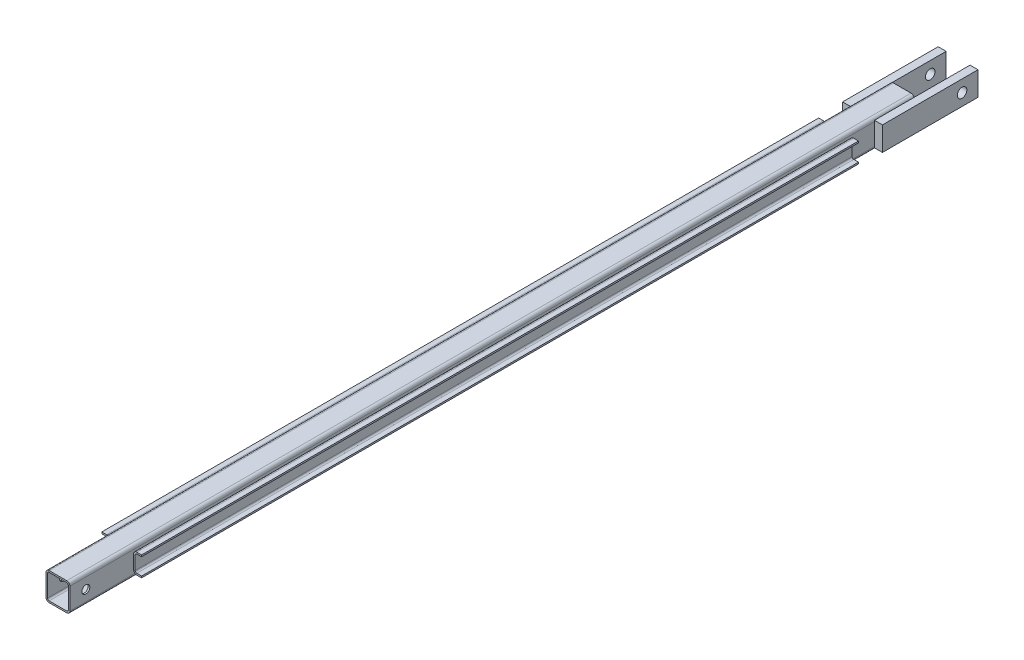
ISO-10303-21;
HEADER;
FILE_DESCRIPTION(('STEP AP214'),'2;1');
FILE_NAME('part.step','',(''),(''),'','','');
FILE_SCHEMA(('AUTOMOTIVE_DESIGN { 1 0 10303 214 1 1 1 1 }'));
ENDSEC;
DATA;
#1=APPLICATION_CONTEXT('core data for automotive mechanical design processes');
#2=APPLICATION_PROTOCOL_DEFINITION('international standard','automotive_design',2000,#1);
#3=PRODUCT_CONTEXT('',#1,'mechanical');
#4=PRODUCT('Part','Part','',(#3));
#5=PRODUCT_RELATED_PRODUCT_CATEGORY('part','',(#4));
#6=PRODUCT_DEFINITION_FORMATION('','',#4);
#7=PRODUCT_DEFINITION_CONTEXT('part definition',#1,'design');
#8=PRODUCT_DEFINITION('design','',#6,#7);
#9=PRODUCT_DEFINITION_SHAPE('','',#8);
#10=(LENGTH_UNIT() NAMED_UNIT(*) SI_UNIT(.MILLI.,.METRE.));
#11=(NAMED_UNIT(*) PLANE_ANGLE_UNIT() SI_UNIT($,.RADIAN.));
#12=(NAMED_UNIT(*) SI_UNIT($,.STERADIAN.) SOLID_ANGLE_UNIT());
#13=UNCERTAINTY_MEASURE_WITH_UNIT(LENGTH_MEASURE(1.E-05),#10,'distance_accuracy_value','');
#14=(GEOMETRIC_REPRESENTATION_CONTEXT(3) GLOBAL_UNCERTAINTY_ASSIGNED_CONTEXT((#13)) GLOBAL_UNIT_ASSIGNED_CONTEXT((#10,
#11,#12)) REPRESENTATION_CONTEXT('',''));
#15=CARTESIAN_POINT('',(0.,0.,0.));
#16=DIRECTION('',(0.,0.,1.));
#17=DIRECTION('',(1.,0.,0.));
#18=AXIS2_PLACEMENT_3D('',#15,#16,#17);
#19=CARTESIAN_POINT('',(-15.,13.5,530.));
#20=DIRECTION('',(1.,0.,0.));
#21=DIRECTION('',(0.,1.,0.));
#22=AXIS2_PLACEMENT_3D('',#19,#20,#21);
#23=PLANE('',#22);
#24=CARTESIAN_POINT('',(-15.,0.,510.));
#25=DIRECTION('',(1.,0.,0.));
#26=DIRECTION('',(0.,1.,0.));
#27=AXIS2_PLACEMENT_3D('',#24,#25,#26);
#28=CIRCLE('',#27,5.00000000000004);
#29=CARTESIAN_POINT('',(-15.,5.00000000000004,510.));
#30=VERTEX_POINT('',#29);
#31=EDGE_CURVE('E743',#30,#30,#28,.T.);
#32=ORIENTED_EDGE('',*,*,#31,.T.);
#33=EDGE_LOOP('',(#32));
#34=FACE_BOUND('',#33,.T.);
#35=DIRECTION('',(0.,0.,-1.));
#36=VECTOR('',#35,1.);
#37=CARTESIAN_POINT('',(-15.,13.5,530.));
#38=LINE('',#37,#36);
#39=CARTESIAN_POINT('',(-15.,13.5,530.));
#40=VERTEX_POINT('',#39);
#41=CARTESIAN_POINT('',(-15.,13.5,-480.));
#42=VERTEX_POINT('',#41);
#43=EDGE_CURVE('E726',#40,#42,#38,.T.);
#44=ORIENTED_EDGE('',*,*,#43,.T.);
#45=DIRECTION('',(0.,-1.,0.));
#46=VECTOR('',#45,1.);
#47=CARTESIAN_POINT('',(-15.,-15.,-480.));
#48=LINE('',#47,#46);
#49=CARTESIAN_POINT('',(-15.,-13.5,-480.));
#50=VERTEX_POINT('',#49);
#51=EDGE_CURVE('E371',#42,#50,#48,.T.);
#52=ORIENTED_EDGE('',*,*,#51,.T.);
#53=DIRECTION('',(0.,0.,-1.));
#54=VECTOR('',#53,1.);
#55=CARTESIAN_POINT('',(-15.,-13.5,530.));
#56=LINE('',#55,#54);
#57=CARTESIAN_POINT('',(-15.,-13.5,530.));
#58=VERTEX_POINT('',#57);
#59=EDGE_CURVE('E723',#58,#50,#56,.T.);
#60=ORIENTED_EDGE('',*,*,#59,.F.);
#61=DIRECTION('',(0.,-1.,0.));
#62=VECTOR('',#61,1.);
#63=CARTESIAN_POINT('',(-15.,13.5,530.));
#64=LINE('',#63,#62);
#65=EDGE_CURVE('E701',#40,#58,#64,.T.);
#66=ORIENTED_EDGE('',*,*,#65,.F.);
#67=EDGE_LOOP('',(#44,#52,#60,#66));
#68=FACE_BOUND('',#67,.T.);
#69=DIRECTION('',(0.,-1.,0.));
#70=VECTOR('',#69,1.);
#71=CARTESIAN_POINT('',(-15.,8.49999999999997,450.));
#72=LINE('',#71,#70);
#73=CARTESIAN_POINT('',(-15.,8.49999999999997,450.));
#74=VERTEX_POINT('',#73);
#75=CARTESIAN_POINT('',(-15.,-8.49999999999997,450.));
#76=VERTEX_POINT('',#75);
#77=EDGE_CURVE('E443',#74,#76,#72,.T.);
#78=ORIENTED_EDGE('',*,*,#77,.T.);
#79=DIRECTION('',(0.,0.,-1.));
#80=VECTOR('',#79,1.);
#81=CARTESIAN_POINT('',(-15.,-8.49999999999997,450.));
#82=LINE('',#81,#80);
#83=CARTESIAN_POINT('',(-15.,-8.49999999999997,-450.));
#84=VERTEX_POINT('',#83);
#85=EDGE_CURVE('E488',#76,#84,#82,.T.);
#86=ORIENTED_EDGE('',*,*,#85,.T.);
#87=DIRECTION('',(0.,-1.,0.));
#88=VECTOR('',#87,1.);
#89=CARTESIAN_POINT('',(-15.,8.49999999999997,-450.));
#90=LINE('',#89,#88);
#91=CARTESIAN_POINT('',(-15.,8.5,-450.));
#92=VERTEX_POINT('',#91);
#93=EDGE_CURVE('E411',#92,#84,#90,.T.);
#94=ORIENTED_EDGE('',*,*,#93,.F.);
#95=DIRECTION('',(0.,0.,-1.));
#96=VECTOR('',#95,1.);
#97=CARTESIAN_POINT('',(-15.,8.49999999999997,450.));
#98=LINE('',#97,#96);
#99=EDGE_CURVE('E486',#74,#92,#98,.T.);
#100=ORIENTED_EDGE('',*,*,#99,.F.);
#101=EDGE_LOOP('',(#78,#86,#94,#100));
#102=FACE_BOUND('',#101,.T.);
#103=ADVANCED_FACE('F29',(#34,#68,#102),#23,.F.);
#104=CARTESIAN_POINT('',(15.,13.5,530.));
#105=DIRECTION('',(-1.,0.,0.));
#106=DIRECTION('',(0.,-1.,0.));
#107=AXIS2_PLACEMENT_3D('',#104,#105,#106);
#108=PLANE('',#107);
#109=CARTESIAN_POINT('',(15.,0.,510.));
#110=DIRECTION('',(1.,0.,0.));
#111=DIRECTION('',(0.,1.,0.));
#112=AXIS2_PLACEMENT_3D('',#109,#110,#111);
#113=CIRCLE('',#112,5.00000000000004);
#114=CARTESIAN_POINT('',(15.,5.00000000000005,510.));
#115=VERTEX_POINT('',#114);
#116=EDGE_CURVE('E751',#115,#115,#113,.T.);
#117=ORIENTED_EDGE('',*,*,#116,.F.);
#118=EDGE_LOOP('',(#117));
#119=FACE_BOUND('',#118,.T.);
#120=DIRECTION('',(0.,-1.,0.));
#121=VECTOR('',#120,1.);
#122=CARTESIAN_POINT('',(15.,8.49999999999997,450.));
#123=LINE('',#122,#121);
#124=CARTESIAN_POINT('',(15.,8.49999999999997,450.));
#125=VERTEX_POINT('',#124);
#126=CARTESIAN_POINT('',(15.,-8.49999999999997,450.));
#127=VERTEX_POINT('',#126);
#128=EDGE_CURVE('E573',#125,#127,#123,.T.);
#129=ORIENTED_EDGE('',*,*,#128,.F.);
#130=DIRECTION('',(0.,0.,-1.));
#131=VECTOR('',#130,1.);
#132=CARTESIAN_POINT('',(15.,8.49999999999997,450.));
#133=LINE('',#132,#131);
#134=CARTESIAN_POINT('',(15.,8.49999999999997,-450.));
#135=VERTEX_POINT('',#134);
#136=EDGE_CURVE('E588',#125,#135,#133,.T.);
#137=ORIENTED_EDGE('',*,*,#136,.T.);
#138=DIRECTION('',(0.,-1.,0.));
#139=VECTOR('',#138,1.);
#140=CARTESIAN_POINT('',(15.,8.49999999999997,-450.));
#141=LINE('',#140,#139);
#142=CARTESIAN_POINT('',(15.,-8.5,-450.));
#143=VERTEX_POINT('',#142);
#144=EDGE_CURVE('E547',#135,#143,#141,.T.);
#145=ORIENTED_EDGE('',*,*,#144,.T.);
#146=DIRECTION('',(0.,0.,-1.));
#147=VECTOR('',#146,1.);
#148=CARTESIAN_POINT('',(15.,-8.49999999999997,450.));
#149=LINE('',#148,#147);
#150=EDGE_CURVE('E585',#127,#143,#149,.T.);
#151=ORIENTED_EDGE('',*,*,#150,.F.);
#152=EDGE_LOOP('',(#129,#137,#145,#151));
#153=FACE_BOUND('',#152,.T.);
#154=DIRECTION('',(0.,-1.,0.));
#155=VECTOR('',#154,1.);
#156=CARTESIAN_POINT('',(15.,-15.,-480.));
#157=LINE('',#156,#155);
#158=CARTESIAN_POINT('',(15.,13.5,-480.));
#159=VERTEX_POINT('',#158);
#160=CARTESIAN_POINT('',(15.,-13.5,-480.));
#161=VERTEX_POINT('',#160);
#162=EDGE_CURVE('E54',#159,#161,#157,.T.);
#163=ORIENTED_EDGE('',*,*,#162,.F.);
#164=DIRECTION('',(0.,0.,-1.));
#165=VECTOR('',#164,1.);
#166=CARTESIAN_POINT('',(15.,13.5,530.));
#167=LINE('',#166,#165);
#168=CARTESIAN_POINT('',(15.,13.5,530.));
#169=VERTEX_POINT('',#168);
#170=EDGE_CURVE('E711',#169,#159,#167,.T.);
#171=ORIENTED_EDGE('',*,*,#170,.F.);
#172=DIRECTION('',(0.,1.,0.));
#173=VECTOR('',#172,1.);
#174=CARTESIAN_POINT('',(15.,13.5,530.));
#175=LINE('',#174,#173);
#176=CARTESIAN_POINT('',(15.,-13.5,530.));
#177=VERTEX_POINT('',#176);
#178=EDGE_CURVE('E709',#177,#169,#175,.T.);
#179=ORIENTED_EDGE('',*,*,#178,.F.);
#180=DIRECTION('',(0.,0.,-1.));
#181=VECTOR('',#180,1.);
#182=CARTESIAN_POINT('',(15.,-13.5,530.));
#183=LINE('',#182,#181);
#184=EDGE_CURVE('E714',#177,#161,#183,.T.);
#185=ORIENTED_EDGE('',*,*,#184,.T.);
#186=EDGE_LOOP('',(#163,#171,#179,#185));
#187=FACE_BOUND('',#186,.T.);
#188=ADVANCED_FACE('F813',(#119,#153,#187),#108,.F.);
#189=CARTESIAN_POINT('',(11.,13.5,530.));
#190=DIRECTION('',(0.,0.,-1.));
#191=DIRECTION('',(-1.,0.,0.));
#192=AXIS2_PLACEMENT_3D('',#189,#190,#191);
#193=PLANE('',#192);
#194=CARTESIAN_POINT('',(11.,13.5,530.));
#195=DIRECTION('',(0.,0.,1.));
#196=DIRECTION('',(-1.,0.,0.));
#197=AXIS2_PLACEMENT_3D('',#194,#195,#196);
#198=CIRCLE('',#197,4.);
#199=CARTESIAN_POINT('',(11.,17.5,530.));
#200=VERTEX_POINT('',#199);
#201=EDGE_CURVE('E694',#169,#200,#198,.T.);
#202=ORIENTED_EDGE('',*,*,#201,.T.);
#203=DIRECTION('',(-1.,0.,0.));
#204=VECTOR('',#203,1.);
#205=CARTESIAN_POINT('',(-11.,17.5,530.));
#206=LINE('',#205,#204);
#207=CARTESIAN_POINT('',(-11.,17.5,530.));
#208=VERTEX_POINT('',#207);
#209=EDGE_CURVE('E697',#200,#208,#206,.T.);
#210=ORIENTED_EDGE('',*,*,#209,.T.);
#211=CARTESIAN_POINT('',(-11.,13.5,530.));
#212=DIRECTION('',(0.,0.,1.));
#213=DIRECTION('',(1.,0.,0.));
#214=AXIS2_PLACEMENT_3D('',#211,#212,#213);
#215=CIRCLE('',#214,4.);
#216=EDGE_CURVE('E699',#208,#40,#215,.T.);
#217=ORIENTED_EDGE('',*,*,#216,.T.);
#218=ORIENTED_EDGE('',*,*,#65,.T.);
#219=CARTESIAN_POINT('',(-11.,-13.5,530.));
#220=DIRECTION('',(0.,0.,1.));
#221=DIRECTION('',(1.,0.,0.));
#222=AXIS2_PLACEMENT_3D('',#219,#220,#221);
#223=CIRCLE('',#222,4.);
#224=CARTESIAN_POINT('',(-11.,-17.5,530.));
#225=VERTEX_POINT('',#224);
#226=EDGE_CURVE('E703',#58,#225,#223,.T.);
#227=ORIENTED_EDGE('',*,*,#226,.T.);
#228=DIRECTION('',(1.,0.,0.));
#229=VECTOR('',#228,1.);
#230=CARTESIAN_POINT('',(-11.,-17.5,530.));
#231=LINE('',#230,#229);
#232=CARTESIAN_POINT('',(11.,-17.5,530.));
#233=VERTEX_POINT('',#232);
#234=EDGE_CURVE('E705',#225,#233,#231,.T.);
#235=ORIENTED_EDGE('',*,*,#234,.T.);
#236=CARTESIAN_POINT('',(11.,-13.5,530.));
#237=DIRECTION('',(0.,0.,1.));
#238=DIRECTION('',(1.,0.,0.));
#239=AXIS2_PLACEMENT_3D('',#236,#237,#238);
#240=CIRCLE('',#239,4.);
#241=EDGE_CURVE('E707',#233,#177,#240,.T.);
#242=ORIENTED_EDGE('',*,*,#241,.T.);
#243=ORIENTED_EDGE('',*,*,#178,.T.);
#244=EDGE_LOOP('',(#202,#210,#217,#218,#227,#235,#242,#243));
#245=FACE_BOUND('',#244,.T.);
#246=CARTESIAN_POINT('',(11.,13.5,530.));
#247=DIRECTION('',(0.,0.,1.));
#248=DIRECTION('',(-1.,0.,0.));
#249=AXIS2_PLACEMENT_3D('',#246,#247,#248);
#250=CIRCLE('',#249,2.);
#251=CARTESIAN_POINT('',(13.,13.5,530.));
#252=VERTEX_POINT('',#251);
#253=CARTESIAN_POINT('',(11.,15.5,530.));
#254=VERTEX_POINT('',#253);
#255=EDGE_CURVE('E639',#252,#254,#250,.T.);
#256=ORIENTED_EDGE('',*,*,#255,.F.);
#257=DIRECTION('',(0.,1.,0.));
#258=VECTOR('',#257,1.);
#259=CARTESIAN_POINT('',(13.,13.5,530.));
#260=LINE('',#259,#258);
#261=CARTESIAN_POINT('',(13.,-13.5,530.));
#262=VERTEX_POINT('',#261);
#263=EDGE_CURVE('E654',#262,#252,#260,.T.);
#264=ORIENTED_EDGE('',*,*,#263,.F.);
#265=CARTESIAN_POINT('',(11.,-13.5,530.));
#266=DIRECTION('',(0.,0.,1.));
#267=DIRECTION('',(1.,0.,0.));
#268=AXIS2_PLACEMENT_3D('',#265,#266,#267);
#269=CIRCLE('',#268,2.);
#270=CARTESIAN_POINT('',(11.,-15.5,530.));
#271=VERTEX_POINT('',#270);
#272=EDGE_CURVE('E651',#271,#262,#269,.T.);
#273=ORIENTED_EDGE('',*,*,#272,.F.);
#274=DIRECTION('',(1.,0.,0.));
#275=VECTOR('',#274,1.);
#276=CARTESIAN_POINT('',(-11.,-15.5,530.));
#277=LINE('',#276,#275);
#278=CARTESIAN_POINT('',(-11.,-15.5,530.));
#279=VERTEX_POINT('',#278);
#280=EDGE_CURVE('E649',#279,#271,#277,.T.);
#281=ORIENTED_EDGE('',*,*,#280,.F.);
#282=CARTESIAN_POINT('',(-11.,-13.5,530.));
#283=DIRECTION('',(0.,0.,1.));
#284=DIRECTION('',(1.,0.,0.));
#285=AXIS2_PLACEMENT_3D('',#282,#283,#284);
#286=CIRCLE('',#285,2.);
#287=CARTESIAN_POINT('',(-13.,-13.5,530.));
#288=VERTEX_POINT('',#287);
#289=EDGE_CURVE('E647',#288,#279,#286,.T.);
#290=ORIENTED_EDGE('',*,*,#289,.F.);
#291=DIRECTION('',(0.,-1.,0.));
#292=VECTOR('',#291,1.);
#293=CARTESIAN_POINT('',(-13.,13.5,530.));
#294=LINE('',#293,#292);
#295=CARTESIAN_POINT('',(-13.,13.5,530.));
#296=VERTEX_POINT('',#295);
#297=EDGE_CURVE('E645',#296,#288,#294,.T.);
#298=ORIENTED_EDGE('',*,*,#297,.F.);
#299=CARTESIAN_POINT('',(-11.,13.5,530.));
#300=DIRECTION('',(0.,0.,1.));
#301=DIRECTION('',(1.,0.,0.));
#302=AXIS2_PLACEMENT_3D('',#299,#300,#301);
#303=CIRCLE('',#302,2.);
#304=CARTESIAN_POINT('',(-11.,15.5,530.));
#305=VERTEX_POINT('',#304);
#306=EDGE_CURVE('E643',#305,#296,#303,.T.);
#307=ORIENTED_EDGE('',*,*,#306,.F.);
#308=DIRECTION('',(-1.,0.,0.));
#309=VECTOR('',#308,1.);
#310=CARTESIAN_POINT('',(-11.,15.5,530.));
#311=LINE('',#310,#309);
#312=EDGE_CURVE('E641',#254,#305,#311,.T.);
#313=ORIENTED_EDGE('',*,*,#312,.F.);
#314=EDGE_LOOP('',(#256,#264,#273,#281,#290,#298,#307,#313));
#315=FACE_BOUND('',#314,.T.);
#316=ADVANCED_FACE('F779',(#245,#315),#193,.F.);
#317=CARTESIAN_POINT('',(11.,13.5,-530.));
#318=DIRECTION('',(0.,0.,-1.));
#319=DIRECTION('',(-1.,0.,0.));
#320=AXIS2_PLACEMENT_3D('',#317,#318,#319);
#321=PLANE('',#320);
#322=CARTESIAN_POINT('',(11.,13.5,-530.));
#323=DIRECTION('',(0.,0.,1.));
#324=DIRECTION('',(-1.,0.,0.));
#325=AXIS2_PLACEMENT_3D('',#322,#323,#324);
#326=CIRCLE('',#325,4.);
#327=CARTESIAN_POINT('',(15.,13.5,-530.));
#328=VERTEX_POINT('',#327);
#329=CARTESIAN_POINT('',(11.,17.5,-530.));
#330=VERTEX_POINT('',#329);
#331=EDGE_CURVE('E674',#328,#330,#326,.T.);
#332=ORIENTED_EDGE('',*,*,#331,.F.);
#333=DIRECTION('',(0.,1.,0.));
#334=VECTOR('',#333,1.);
#335=CARTESIAN_POINT('',(15.,13.5,-530.));
#336=LINE('',#335,#334);
#337=CARTESIAN_POINT('',(15.,-13.5,-530.));
#338=VERTEX_POINT('',#337);
#339=EDGE_CURVE('E691',#338,#328,#336,.T.);
#340=ORIENTED_EDGE('',*,*,#339,.F.);
#341=CARTESIAN_POINT('',(11.,-13.5,-530.));
#342=DIRECTION('',(0.,0.,1.));
#343=DIRECTION('',(1.,0.,0.));
#344=AXIS2_PLACEMENT_3D('',#341,#342,#343);
#345=CIRCLE('',#344,4.);
#346=CARTESIAN_POINT('',(11.,-17.5,-530.));
#347=VERTEX_POINT('',#346);
#348=EDGE_CURVE('E688',#347,#338,#345,.T.);
#349=ORIENTED_EDGE('',*,*,#348,.F.);
#350=DIRECTION('',(1.,0.,0.));
#351=VECTOR('',#350,1.);
#352=CARTESIAN_POINT('',(-11.,-17.5,-530.));
#353=LINE('',#352,#351);
#354=CARTESIAN_POINT('',(-11.,-17.5,-530.));
#355=VERTEX_POINT('',#354);
#356=EDGE_CURVE('E686',#355,#347,#353,.T.);
#357=ORIENTED_EDGE('',*,*,#356,.F.);
#358=CARTESIAN_POINT('',(-11.,-13.5,-530.));
#359=DIRECTION('',(0.,0.,1.));
#360=DIRECTION('',(1.,0.,0.));
#361=AXIS2_PLACEMENT_3D('',#358,#359,#360);
#362=CIRCLE('',#361,4.);
#363=CARTESIAN_POINT('',(-15.,-13.5,-530.));
#364=VERTEX_POINT('',#363);
#365=EDGE_CURVE('E684',#364,#355,#362,.T.);
#366=ORIENTED_EDGE('',*,*,#365,.F.);
#367=DIRECTION('',(0.,-1.,0.));
#368=VECTOR('',#367,1.);
#369=CARTESIAN_POINT('',(-15.,13.5,-530.));
#370=LINE('',#369,#368);
#371=CARTESIAN_POINT('',(-15.,13.5,-530.));
#372=VERTEX_POINT('',#371);
#373=EDGE_CURVE('E682',#372,#364,#370,.T.);
#374=ORIENTED_EDGE('',*,*,#373,.F.);
#375=CARTESIAN_POINT('',(-11.,13.5,-530.));
#376=DIRECTION('',(0.,0.,1.));
#377=DIRECTION('',(1.,0.,0.));
#378=AXIS2_PLACEMENT_3D('',#375,#376,#377);
#379=CIRCLE('',#378,4.);
#380=CARTESIAN_POINT('',(-11.,17.5,-530.));
#381=VERTEX_POINT('',#380);
#382=EDGE_CURVE('E679',#381,#372,#379,.T.);
#383=ORIENTED_EDGE('',*,*,#382,.F.);
#384=DIRECTION('',(-1.,0.,0.));
#385=VECTOR('',#384,1.);
#386=CARTESIAN_POINT('',(-11.,17.5,-530.));
#387=LINE('',#386,#385);
#388=EDGE_CURVE('E677',#330,#381,#387,.T.);
#389=ORIENTED_EDGE('',*,*,#388,.F.);
#390=EDGE_LOOP('',(#332,#340,#349,#357,#366,#374,#383,#389));
#391=FACE_BOUND('',#390,.T.);
#392=DIRECTION('',(0.,1.,0.));
#393=VECTOR('',#392,1.);
#394=CARTESIAN_POINT('',(13.,13.5,-530.));
#395=LINE('',#394,#393);
#396=CARTESIAN_POINT('',(13.,-13.5,-530.));
#397=VERTEX_POINT('',#396);
#398=CARTESIAN_POINT('',(13.,13.5,-530.));
#399=VERTEX_POINT('',#398);
#400=EDGE_CURVE('E636',#397,#399,#395,.T.);
#401=ORIENTED_EDGE('',*,*,#400,.T.);
#402=CARTESIAN_POINT('',(11.,13.5,-530.));
#403=DIRECTION('',(0.,0.,1.));
#404=DIRECTION('',(-1.,0.,0.));
#405=AXIS2_PLACEMENT_3D('',#402,#403,#404);
#406=CIRCLE('',#405,2.);
#407=CARTESIAN_POINT('',(11.,15.5,-530.));
#408=VERTEX_POINT('',#407);
#409=EDGE_CURVE('E615',#399,#408,#406,.T.);
#410=ORIENTED_EDGE('',*,*,#409,.T.);
#411=DIRECTION('',(-1.,0.,0.));
#412=VECTOR('',#411,1.);
#413=CARTESIAN_POINT('',(-11.,15.5,-530.));
#414=LINE('',#413,#412);
#415=CARTESIAN_POINT('',(-11.,15.5,-530.));
#416=VERTEX_POINT('',#415);
#417=EDGE_CURVE('E618',#408,#416,#414,.T.);
#418=ORIENTED_EDGE('',*,*,#417,.T.);
#419=CARTESIAN_POINT('',(-11.,13.5,-530.));
#420=DIRECTION('',(0.,0.,1.));
#421=DIRECTION('',(1.,0.,0.));
#422=AXIS2_PLACEMENT_3D('',#419,#420,#421);
#423=CIRCLE('',#422,2.);
#424=CARTESIAN_POINT('',(-13.,13.5,-530.));
#425=VERTEX_POINT('',#424);
#426=EDGE_CURVE('E621',#416,#425,#423,.T.);
#427=ORIENTED_EDGE('',*,*,#426,.T.);
#428=DIRECTION('',(0.,-1.,0.));
#429=VECTOR('',#428,1.);
#430=CARTESIAN_POINT('',(-13.,13.5,-530.));
#431=LINE('',#430,#429);
#432=CARTESIAN_POINT('',(-13.,-13.5,-530.));
#433=VERTEX_POINT('',#432);
#434=EDGE_CURVE('E624',#425,#433,#431,.T.);
#435=ORIENTED_EDGE('',*,*,#434,.T.);
#436=CARTESIAN_POINT('',(-11.,-13.5,-530.));
#437=DIRECTION('',(0.,0.,1.));
#438=DIRECTION('',(1.,0.,0.));
#439=AXIS2_PLACEMENT_3D('',#436,#437,#438);
#440=CIRCLE('',#439,2.);
#441=CARTESIAN_POINT('',(-11.,-15.5,-530.));
#442=VERTEX_POINT('',#441);
#443=EDGE_CURVE('E627',#433,#442,#440,.T.);
#444=ORIENTED_EDGE('',*,*,#443,.T.);
#445=DIRECTION('',(1.,0.,0.));
#446=VECTOR('',#445,1.);
#447=CARTESIAN_POINT('',(-11.,-15.5,-530.));
#448=LINE('',#447,#446);
#449=CARTESIAN_POINT('',(11.,-15.5,-530.));
#450=VERTEX_POINT('',#449);
#451=EDGE_CURVE('E630',#442,#450,#448,.T.);
#452=ORIENTED_EDGE('',*,*,#451,.T.);
#453=CARTESIAN_POINT('',(11.,-13.5,-530.));
#454=DIRECTION('',(0.,0.,1.));
#455=DIRECTION('',(1.,0.,0.));
#456=AXIS2_PLACEMENT_3D('',#453,#454,#455);
#457=CIRCLE('',#456,2.);
#458=EDGE_CURVE('E633',#450,#397,#457,.T.);
#459=ORIENTED_EDGE('',*,*,#458,.T.);
#460=EDGE_LOOP('',(#401,#410,#418,#427,#435,#444,#452,#459));
#461=FACE_BOUND('',#460,.T.);
#462=ADVANCED_FACE('F770',(#391,#461),#321,.T.);
#463=CARTESIAN_POINT('',(11.,13.5,530.));
#464=DIRECTION('',(0.,0.,-1.));
#465=DIRECTION('',(-1.,0.,0.));
#466=AXIS2_PLACEMENT_3D('',#463,#464,#465);
#467=CYLINDRICAL_SURFACE('',#466,4.);
#468=ORIENTED_EDGE('',*,*,#331,.T.);
#469=DIRECTION('',(0.,0.,-1.));
#470=VECTOR('',#469,1.);
#471=CARTESIAN_POINT('',(11.,17.5,530.));
#472=LINE('',#471,#470);
#473=EDGE_CURVE('E11',#200,#330,#472,.T.);
#474=ORIENTED_EDGE('',*,*,#473,.F.);
#475=ORIENTED_EDGE('',*,*,#201,.F.);
#476=ORIENTED_EDGE('',*,*,#170,.T.);
#477=DIRECTION('',(0.,0.,-1.));
#478=VECTOR('',#477,1.);
#479=CARTESIAN_POINT('',(15.,13.5,530.));
#480=LINE('',#479,#478);
#481=EDGE_CURVE('E526',#159,#328,#480,.T.);
#482=ORIENTED_EDGE('',*,*,#481,.T.);
#483=EDGE_LOOP('',(#468,#474,#475,#476,#482));
#484=FACE_BOUND('',#483,.T.);
#485=ADVANCED_FACE('F31',(#484),#467,.T.);
#486=CARTESIAN_POINT('',(-11.,17.5,530.));
#487=DIRECTION('',(0.,-1.,0.));
#488=DIRECTION('',(0.,0.,-1.));
#489=AXIS2_PLACEMENT_3D('',#486,#487,#488);
#490=PLANE('',#489);
#491=ORIENTED_EDGE('',*,*,#388,.T.);
#492=DIRECTION('',(0.,0.,-1.));
#493=VECTOR('',#492,1.);
#494=CARTESIAN_POINT('',(-11.,17.5,530.));
#495=LINE('',#494,#493);
#496=EDGE_CURVE('E38',#208,#381,#495,.T.);
#497=ORIENTED_EDGE('',*,*,#496,.F.);
#498=ORIENTED_EDGE('',*,*,#209,.F.);
#499=ORIENTED_EDGE('',*,*,#473,.T.);
#500=EDGE_LOOP('',(#491,#497,#498,#499));
#501=FACE_BOUND('',#500,.T.);
#502=ADVANCED_FACE('F828',(#501),#490,.F.);
#503=CARTESIAN_POINT('',(-11.,13.5,530.));
#504=DIRECTION('',(0.,0.,-1.));
#505=DIRECTION('',(-1.,0.,0.));
#506=AXIS2_PLACEMENT_3D('',#503,#504,#505);
#507=CYLINDRICAL_SURFACE('',#506,4.);
#508=ORIENTED_EDGE('',*,*,#382,.T.);
#509=DIRECTION('',(0.,0.,-1.));
#510=VECTOR('',#509,1.);
#511=CARTESIAN_POINT('',(-15.,13.5,530.));
#512=LINE('',#511,#510);
#513=EDGE_CURVE('E363',#42,#372,#512,.T.);
#514=ORIENTED_EDGE('',*,*,#513,.F.);
#515=ORIENTED_EDGE('',*,*,#43,.F.);
#516=ORIENTED_EDGE('',*,*,#216,.F.);
#517=ORIENTED_EDGE('',*,*,#496,.T.);
#518=EDGE_LOOP('',(#508,#514,#515,#516,#517));
#519=FACE_BOUND('',#518,.T.);
#520=ADVANCED_FACE('F826',(#519),#507,.T.);
#521=CARTESIAN_POINT('',(-11.,-13.5,530.));
#522=DIRECTION('',(0.,0.,-1.));
#523=DIRECTION('',(-1.,0.,0.));
#524=AXIS2_PLACEMENT_3D('',#521,#522,#523);
#525=CYLINDRICAL_SURFACE('',#524,4.);
#526=ORIENTED_EDGE('',*,*,#365,.T.);
#527=DIRECTION('',(0.,0.,-1.));
#528=VECTOR('',#527,1.);
#529=CARTESIAN_POINT('',(-11.,-17.5,530.));
#530=LINE('',#529,#528);
#531=EDGE_CURVE('E719',#225,#355,#530,.T.);
#532=ORIENTED_EDGE('',*,*,#531,.F.);
#533=ORIENTED_EDGE('',*,*,#226,.F.);
#534=ORIENTED_EDGE('',*,*,#59,.T.);
#535=EDGE_CURVE('E722',#50,#364,#56,.T.);
#536=ORIENTED_EDGE('',*,*,#535,.T.);
#537=EDGE_LOOP('',(#526,#532,#533,#534,#536));
#538=FACE_BOUND('',#537,.T.);
#539=ADVANCED_FACE('F824',(#538),#525,.T.);
#540=CARTESIAN_POINT('',(-11.,-17.5,530.));
#541=DIRECTION('',(0.,1.,0.));
#542=DIRECTION('',(0.,0.,1.));
#543=AXIS2_PLACEMENT_3D('',#540,#541,#542);
#544=PLANE('',#543);
#545=ORIENTED_EDGE('',*,*,#356,.T.);
#546=DIRECTION('',(0.,0.,-1.));
#547=VECTOR('',#546,1.);
#548=CARTESIAN_POINT('',(11.,-17.5,530.));
#549=LINE('',#548,#547);
#550=EDGE_CURVE('E716',#233,#347,#549,.T.);
#551=ORIENTED_EDGE('',*,*,#550,.F.);
#552=ORIENTED_EDGE('',*,*,#234,.F.);
#553=ORIENTED_EDGE('',*,*,#531,.T.);
#554=EDGE_LOOP('',(#545,#551,#552,#553));
#555=FACE_BOUND('',#554,.T.);
#556=ADVANCED_FACE('F1252',(#555),#544,.F.);
#557=CARTESIAN_POINT('',(11.,-13.5,530.));
#558=DIRECTION('',(0.,0.,-1.));
#559=DIRECTION('',(-1.,0.,0.));
#560=AXIS2_PLACEMENT_3D('',#557,#558,#559);
#561=CYLINDRICAL_SURFACE('',#560,4.);
#562=ORIENTED_EDGE('',*,*,#348,.T.);
#563=EDGE_CURVE('E713',#161,#338,#183,.T.);
#564=ORIENTED_EDGE('',*,*,#563,.F.);
#565=ORIENTED_EDGE('',*,*,#184,.F.);
#566=ORIENTED_EDGE('',*,*,#241,.F.);
#567=ORIENTED_EDGE('',*,*,#550,.T.);
#568=EDGE_LOOP('',(#562,#564,#565,#566,#567));
#569=FACE_BOUND('',#568,.T.);
#570=ADVANCED_FACE('F1245',(#569),#561,.T.);
#571=CARTESIAN_POINT('',(11.,13.5,530.));
#572=DIRECTION('',(0.,0.,-1.));
#573=DIRECTION('',(-1.,0.,0.));
#574=AXIS2_PLACEMENT_3D('',#571,#572,#573);
#575=CYLINDRICAL_SURFACE('',#574,2.);
#576=ORIENTED_EDGE('',*,*,#409,.F.);
#577=DIRECTION('',(0.,0.,-1.));
#578=VECTOR('',#577,1.);
#579=CARTESIAN_POINT('',(13.,13.5,530.));
#580=LINE('',#579,#578);
#581=EDGE_CURVE('E656',#252,#399,#580,.T.);
#582=ORIENTED_EDGE('',*,*,#581,.F.);
#583=ORIENTED_EDGE('',*,*,#255,.T.);
#584=DIRECTION('',(0.,0.,-1.));
#585=VECTOR('',#584,1.);
#586=CARTESIAN_POINT('',(11.,15.5,530.));
#587=LINE('',#586,#585);
#588=EDGE_CURVE('E671',#254,#408,#587,.T.);
#589=ORIENTED_EDGE('',*,*,#588,.T.);
#590=EDGE_LOOP('',(#576,#582,#583,#589));
#591=FACE_BOUND('',#590,.T.);
#592=ADVANCED_FACE('F782',(#591),#575,.F.);
#593=CARTESIAN_POINT('',(-11.,15.5,530.));
#594=DIRECTION('',(0.,-1.,0.));
#595=DIRECTION('',(0.,0.,-1.));
#596=AXIS2_PLACEMENT_3D('',#593,#594,#595);
#597=PLANE('',#596);
#598=ORIENTED_EDGE('',*,*,#417,.F.);
#599=ORIENTED_EDGE('',*,*,#588,.F.);
#600=ORIENTED_EDGE('',*,*,#312,.T.);
#601=DIRECTION('',(0.,0.,-1.));
#602=VECTOR('',#601,1.);
#603=CARTESIAN_POINT('',(-11.,15.5,530.));
#604=LINE('',#603,#602);
#605=EDGE_CURVE('E669',#305,#416,#604,.T.);
#606=ORIENTED_EDGE('',*,*,#605,.T.);
#607=EDGE_LOOP('',(#598,#599,#600,#606));
#608=FACE_BOUND('',#607,.T.);
#609=ADVANCED_FACE('F786',(#608),#597,.T.);
#610=CARTESIAN_POINT('',(-11.,13.5,530.));
#611=DIRECTION('',(0.,0.,-1.));
#612=DIRECTION('',(-1.,0.,0.));
#613=AXIS2_PLACEMENT_3D('',#610,#611,#612);
#614=CYLINDRICAL_SURFACE('',#613,2.);
#615=ORIENTED_EDGE('',*,*,#426,.F.);
#616=ORIENTED_EDGE('',*,*,#605,.F.);
#617=ORIENTED_EDGE('',*,*,#306,.T.);
#618=DIRECTION('',(0.,0.,-1.));
#619=VECTOR('',#618,1.);
#620=CARTESIAN_POINT('',(-13.,13.5,530.));
#621=LINE('',#620,#619);
#622=EDGE_CURVE('E667',#296,#425,#621,.T.);
#623=ORIENTED_EDGE('',*,*,#622,.T.);
#624=EDGE_LOOP('',(#615,#616,#617,#623));
#625=FACE_BOUND('',#624,.T.);
#626=ADVANCED_FACE('F790',(#625),#614,.F.);
#627=CARTESIAN_POINT('',(-13.,13.5,530.));
#628=DIRECTION('',(1.,0.,0.));
#629=DIRECTION('',(0.,1.,0.));
#630=AXIS2_PLACEMENT_3D('',#627,#628,#629);
#631=PLANE('',#630);
#632=CARTESIAN_POINT('',(-13.,0.,510.));
#633=DIRECTION('',(1.,0.,0.));
#634=DIRECTION('',(0.,1.,0.));
#635=AXIS2_PLACEMENT_3D('',#632,#633,#634);
#636=CIRCLE('',#635,5.00000000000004);
#637=CARTESIAN_POINT('',(-13.,5.00000000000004,510.));
#638=VERTEX_POINT('',#637);
#639=EDGE_CURVE('E748',#638,#638,#636,.T.);
#640=ORIENTED_EDGE('',*,*,#639,.F.);
#641=EDGE_LOOP('',(#640));
#642=FACE_BOUND('',#641,.T.);
#643=ORIENTED_EDGE('',*,*,#434,.F.);
#644=ORIENTED_EDGE('',*,*,#622,.F.);
#645=ORIENTED_EDGE('',*,*,#297,.T.);
#646=DIRECTION('',(0.,0.,-1.));
#647=VECTOR('',#646,1.);
#648=CARTESIAN_POINT('',(-13.,-13.5,530.));
#649=LINE('',#648,#647);
#650=EDGE_CURVE('E665',#288,#433,#649,.T.);
#651=ORIENTED_EDGE('',*,*,#650,.T.);
#652=EDGE_LOOP('',(#643,#644,#645,#651));
#653=FACE_BOUND('',#652,.T.);
#654=ADVANCED_FACE('F795',(#642,#653),#631,.T.);
#655=CARTESIAN_POINT('',(-11.,-13.5,530.));
#656=DIRECTION('',(0.,0.,-1.));
#657=DIRECTION('',(-1.,0.,0.));
#658=AXIS2_PLACEMENT_3D('',#655,#656,#657);
#659=CYLINDRICAL_SURFACE('',#658,2.);
#660=ORIENTED_EDGE('',*,*,#443,.F.);
#661=ORIENTED_EDGE('',*,*,#650,.F.);
#662=ORIENTED_EDGE('',*,*,#289,.T.);
#663=DIRECTION('',(0.,0.,-1.));
#664=VECTOR('',#663,1.);
#665=CARTESIAN_POINT('',(-11.,-15.5,530.));
#666=LINE('',#665,#664);
#667=EDGE_CURVE('E663',#279,#442,#666,.T.);
#668=ORIENTED_EDGE('',*,*,#667,.T.);
#669=EDGE_LOOP('',(#660,#661,#662,#668));
#670=FACE_BOUND('',#669,.T.);
#671=ADVANCED_FACE('F799',(#670),#659,.F.);
#672=CARTESIAN_POINT('',(-11.,-15.5,530.));
#673=DIRECTION('',(0.,1.,0.));
#674=DIRECTION('',(-1.,0.,0.));
#675=AXIS2_PLACEMENT_3D('',#672,#673,#674);
#676=PLANE('',#675);
#677=ORIENTED_EDGE('',*,*,#451,.F.);
#678=ORIENTED_EDGE('',*,*,#667,.F.);
#679=ORIENTED_EDGE('',*,*,#280,.T.);
#680=DIRECTION('',(0.,0.,-1.));
#681=VECTOR('',#680,1.);
#682=CARTESIAN_POINT('',(11.,-15.5,530.));
#683=LINE('',#682,#681);
#684=EDGE_CURVE('E661',#271,#450,#683,.T.);
#685=ORIENTED_EDGE('',*,*,#684,.T.);
#686=EDGE_LOOP('',(#677,#678,#679,#685));
#687=FACE_BOUND('',#686,.T.);
#688=ADVANCED_FACE('F803',(#687),#676,.T.);
#689=CARTESIAN_POINT('',(11.,-13.5,530.));
#690=DIRECTION('',(0.,0.,-1.));
#691=DIRECTION('',(-1.,0.,0.));
#692=AXIS2_PLACEMENT_3D('',#689,#690,#691);
#693=CYLINDRICAL_SURFACE('',#692,2.);
#694=ORIENTED_EDGE('',*,*,#458,.F.);
#695=ORIENTED_EDGE('',*,*,#684,.F.);
#696=ORIENTED_EDGE('',*,*,#272,.T.);
#697=DIRECTION('',(0.,0.,-1.));
#698=VECTOR('',#697,1.);
#699=CARTESIAN_POINT('',(13.,-13.5,530.));
#700=LINE('',#699,#698);
#701=EDGE_CURVE('E659',#262,#397,#700,.T.);
#702=ORIENTED_EDGE('',*,*,#701,.T.);
#703=EDGE_LOOP('',(#694,#695,#696,#702));
#704=FACE_BOUND('',#703,.T.);
#705=ADVANCED_FACE('F764',(#704),#693,.F.);
#706=CARTESIAN_POINT('',(13.,13.5,530.));
#707=DIRECTION('',(-1.,0.,0.));
#708=DIRECTION('',(0.,-1.,0.));
#709=AXIS2_PLACEMENT_3D('',#706,#707,#708);
#710=PLANE('',#709);
#711=CARTESIAN_POINT('',(13.,0.,510.));
#712=DIRECTION('',(-1.,0.,0.));
#713=DIRECTION('',(0.,-1.,0.));
#714=AXIS2_PLACEMENT_3D('',#711,#712,#713);
#715=CIRCLE('',#714,5.00000000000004);
#716=CARTESIAN_POINT('',(13.,-5.00000000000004,510.));
#717=VERTEX_POINT('',#716);
#718=EDGE_CURVE('E33',#717,#717,#715,.T.);
#719=ORIENTED_EDGE('',*,*,#718,.F.);
#720=EDGE_LOOP('',(#719));
#721=FACE_BOUND('',#720,.T.);
#722=ORIENTED_EDGE('',*,*,#400,.F.);
#723=ORIENTED_EDGE('',*,*,#701,.F.);
#724=ORIENTED_EDGE('',*,*,#263,.T.);
#725=ORIENTED_EDGE('',*,*,#581,.T.);
#726=EDGE_LOOP('',(#722,#723,#724,#725));
#727=FACE_BOUND('',#726,.T.);
#728=ADVANCED_FACE('F760',(#721,#727),#710,.T.);
#729=CARTESIAN_POINT('',(25.,-12.5,450.));
#730=DIRECTION('',(-1.,0.,0.));
#731=DIRECTION('',(0.,0.,1.));
#732=AXIS2_PLACEMENT_3D('',#729,#730,#731);
#733=PLANE('',#732);
#734=DIRECTION('',(0.,1.,0.));
#735=VECTOR('',#734,1.);
#736=CARTESIAN_POINT('',(25.,-12.5,-450.));
#737=LINE('',#736,#735);
#738=CARTESIAN_POINT('',(25.,-12.5,-450.));
#739=VERTEX_POINT('',#738);
#740=CARTESIAN_POINT('',(25.,-10.5,-450.));
#741=VERTEX_POINT('',#740);
#742=EDGE_CURVE('E528',#739,#741,#737,.T.);
#743=ORIENTED_EDGE('',*,*,#742,.T.);
#744=DIRECTION('',(0.,0.,-1.));
#745=VECTOR('',#744,1.);
#746=CARTESIAN_POINT('',(25.,-10.5,450.));
#747=LINE('',#746,#745);
#748=CARTESIAN_POINT('',(25.,-10.5,450.));
#749=VERTEX_POINT('',#748);
#750=EDGE_CURVE('E612',#749,#741,#747,.T.);
#751=ORIENTED_EDGE('',*,*,#750,.F.);
#752=DIRECTION('',(0.,1.,0.));
#753=VECTOR('',#752,1.);
#754=CARTESIAN_POINT('',(25.,-12.5,450.));
#755=LINE('',#754,#753);
#756=CARTESIAN_POINT('',(25.,-12.5,450.));
#757=VERTEX_POINT('',#756);
#758=EDGE_CURVE('E554',#757,#749,#755,.T.);
#759=ORIENTED_EDGE('',*,*,#758,.F.);
#760=DIRECTION('',(0.,0.,-1.));
#761=VECTOR('',#760,1.);
#762=CARTESIAN_POINT('',(25.,-12.5,450.));
#763=LINE('',#762,#761);
#764=EDGE_CURVE('E579',#757,#739,#763,.T.);
#765=ORIENTED_EDGE('',*,*,#764,.T.);
#766=EDGE_LOOP('',(#743,#751,#759,#765));
#767=FACE_BOUND('',#766,.T.);
#768=ADVANCED_FACE('F763',(#767),#733,.F.);
#769=CARTESIAN_POINT('',(25.,-10.5,450.));
#770=DIRECTION('',(0.,-1.,0.));
#771=DIRECTION('',(0.,0.,-1.));
#772=AXIS2_PLACEMENT_3D('',#769,#770,#771);
#773=PLANE('',#772);
#774=DIRECTION('',(-1.,0.,0.));
#775=VECTOR('',#774,1.);
#776=CARTESIAN_POINT('',(25.,-10.5,-450.));
#777=LINE('',#776,#775);
#778=CARTESIAN_POINT('',(19.,-10.5,-450.));
#779=VERTEX_POINT('',#778);
#780=EDGE_CURVE('E531',#741,#779,#777,.T.);
#781=ORIENTED_EDGE('',*,*,#780,.T.);
#782=DIRECTION('',(0.,0.,-1.));
#783=VECTOR('',#782,1.);
#784=CARTESIAN_POINT('',(19.,-10.5,450.));
#785=LINE('',#784,#783);
#786=CARTESIAN_POINT('',(19.,-10.5,450.));
#787=VERTEX_POINT('',#786);
#788=EDGE_CURVE('E609',#787,#779,#785,.T.);
#789=ORIENTED_EDGE('',*,*,#788,.F.);
#790=DIRECTION('',(-1.,0.,0.));
#791=VECTOR('',#790,1.);
#792=CARTESIAN_POINT('',(25.,-10.5,450.));
#793=LINE('',#792,#791);
#794=EDGE_CURVE('E557',#749,#787,#793,.T.);
#795=ORIENTED_EDGE('',*,*,#794,.F.);
#796=ORIENTED_EDGE('',*,*,#750,.T.);
#797=EDGE_LOOP('',(#781,#789,#795,#796));
#798=FACE_BOUND('',#797,.T.);
#799=ADVANCED_FACE('F998',(#798),#773,.F.);
#800=CARTESIAN_POINT('',(19.,-8.5,450.));
#801=DIRECTION('',(0.,0.,-1.));
#802=DIRECTION('',(-1.,0.,0.));
#803=AXIS2_PLACEMENT_3D('',#800,#801,#802);
#804=CYLINDRICAL_SURFACE('',#803,2.);
#805=CARTESIAN_POINT('',(19.,-8.5,-450.));
#806=DIRECTION('',(0.,0.,-1.));
#807=DIRECTION('',(-1.,0.,0.));
#808=AXIS2_PLACEMENT_3D('',#805,#806,#807);
#809=CIRCLE('',#808,2.);
#810=CARTESIAN_POINT('',(17.,-8.49999999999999,-450.));
#811=VERTEX_POINT('',#810);
#812=EDGE_CURVE('E533',#779,#811,#809,.T.);
#813=ORIENTED_EDGE('',*,*,#812,.T.);
#814=DIRECTION('',(0.,0.,-1.));
#815=VECTOR('',#814,1.);
#816=CARTESIAN_POINT('',(17.,-8.49999999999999,450.));
#817=LINE('',#816,#815);
#818=CARTESIAN_POINT('',(17.,-8.49999999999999,450.));
#819=VERTEX_POINT('',#818);
#820=EDGE_CURVE('E606',#819,#811,#817,.T.);
#821=ORIENTED_EDGE('',*,*,#820,.F.);
#822=CARTESIAN_POINT('',(19.,-8.5,450.));
#823=DIRECTION('',(0.,0.,-1.));
#824=DIRECTION('',(-1.,0.,0.));
#825=AXIS2_PLACEMENT_3D('',#822,#823,#824);
#826=CIRCLE('',#825,2.);
#827=EDGE_CURVE('E559',#787,#819,#826,.T.);
#828=ORIENTED_EDGE('',*,*,#827,.F.);
#829=ORIENTED_EDGE('',*,*,#788,.T.);
#830=EDGE_LOOP('',(#813,#821,#828,#829));
#831=FACE_BOUND('',#830,.T.);
#832=ADVANCED_FACE('F994',(#831),#804,.F.);
#833=CARTESIAN_POINT('',(17.,-8.49999999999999,450.));
#834=DIRECTION('',(-1.,0.,0.));
#835=DIRECTION('',(0.,0.,1.));
#836=AXIS2_PLACEMENT_3D('',#833,#834,#835);
#837=PLANE('',#836);
#838=DIRECTION('',(0.,1.,0.));
#839=VECTOR('',#838,1.);
#840=CARTESIAN_POINT('',(17.,-8.49999999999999,-450.));
#841=LINE('',#840,#839);
#842=CARTESIAN_POINT('',(17.,8.49999999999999,-450.));
#843=VERTEX_POINT('',#842);
#844=EDGE_CURVE('E535',#811,#843,#841,.T.);
#845=ORIENTED_EDGE('',*,*,#844,.T.);
#846=DIRECTION('',(0.,0.,-1.));
#847=VECTOR('',#846,1.);
#848=CARTESIAN_POINT('',(17.,8.49999999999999,450.));
#849=LINE('',#848,#847);
#850=CARTESIAN_POINT('',(17.,8.49999999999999,450.));
#851=VERTEX_POINT('',#850);
#852=EDGE_CURVE('E603',#851,#843,#849,.T.);
#853=ORIENTED_EDGE('',*,*,#852,.F.);
#854=DIRECTION('',(0.,1.,0.));
#855=VECTOR('',#854,1.);
#856=CARTESIAN_POINT('',(17.,-8.49999999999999,450.));
#857=LINE('',#856,#855);
#858=EDGE_CURVE('E561',#819,#851,#857,.T.);
#859=ORIENTED_EDGE('',*,*,#858,.F.);
#860=ORIENTED_EDGE('',*,*,#820,.T.);
#861=EDGE_LOOP('',(#845,#853,#859,#860));
#862=FACE_BOUND('',#861,.T.);
#863=ADVANCED_FACE('F990',(#862),#837,.F.);
#864=CARTESIAN_POINT('',(19.,8.5,450.));
#865=DIRECTION('',(0.,0.,-1.));
#866=DIRECTION('',(-1.,0.,0.));
#867=AXIS2_PLACEMENT_3D('',#864,#865,#866);
#868=CYLINDRICAL_SURFACE('',#867,2.);
#869=CARTESIAN_POINT('',(19.,8.5,-450.));
#870=DIRECTION('',(0.,0.,-1.));
#871=DIRECTION('',(-1.,0.,0.));
#872=AXIS2_PLACEMENT_3D('',#869,#870,#871);
#873=CIRCLE('',#872,2.);
#874=CARTESIAN_POINT('',(19.,10.5,-450.));
#875=VERTEX_POINT('',#874);
#876=EDGE_CURVE('E537',#843,#875,#873,.T.);
#877=ORIENTED_EDGE('',*,*,#876,.T.);
#878=DIRECTION('',(0.,0.,-1.));
#879=VECTOR('',#878,1.);
#880=CARTESIAN_POINT('',(19.,10.5,450.));
#881=LINE('',#880,#879);
#882=CARTESIAN_POINT('',(19.,10.5,450.));
#883=VERTEX_POINT('',#882);
#884=EDGE_CURVE('E600',#883,#875,#881,.T.);
#885=ORIENTED_EDGE('',*,*,#884,.F.);
#886=CARTESIAN_POINT('',(19.,8.5,450.));
#887=DIRECTION('',(0.,0.,-1.));
#888=DIRECTION('',(-1.,0.,0.));
#889=AXIS2_PLACEMENT_3D('',#886,#887,#888);
#890=CIRCLE('',#889,2.);
#891=EDGE_CURVE('E563',#851,#883,#890,.T.);
#892=ORIENTED_EDGE('',*,*,#891,.F.);
#893=ORIENTED_EDGE('',*,*,#852,.T.);
#894=EDGE_LOOP('',(#877,#885,#892,#893));
#895=FACE_BOUND('',#894,.T.);
#896=ADVANCED_FACE('F986',(#895),#868,.F.);
#897=CARTESIAN_POINT('',(19.,10.5,450.));
#898=DIRECTION('',(0.,1.,0.));
#899=DIRECTION('',(0.,0.,1.));
#900=AXIS2_PLACEMENT_3D('',#897,#898,#899);
#901=PLANE('',#900);
#902=DIRECTION('',(1.,0.,0.));
#903=VECTOR('',#902,1.);
#904=CARTESIAN_POINT('',(19.,10.5,-450.));
#905=LINE('',#904,#903);
#906=CARTESIAN_POINT('',(25.,10.5,-450.));
#907=VERTEX_POINT('',#906);
#908=EDGE_CURVE('E539',#875,#907,#905,.T.);
#909=ORIENTED_EDGE('',*,*,#908,.T.);
#910=DIRECTION('',(0.,0.,-1.));
#911=VECTOR('',#910,1.);
#912=CARTESIAN_POINT('',(25.,10.5,450.));
#913=LINE('',#912,#911);
#914=CARTESIAN_POINT('',(25.,10.5,450.));
#915=VERTEX_POINT('',#914);
#916=EDGE_CURVE('E597',#915,#907,#913,.T.);
#917=ORIENTED_EDGE('',*,*,#916,.F.);
#918=DIRECTION('',(1.,0.,0.));
#919=VECTOR('',#918,1.);
#920=CARTESIAN_POINT('',(19.,10.5,450.));
#921=LINE('',#920,#919);
#922=EDGE_CURVE('E565',#883,#915,#921,.T.);
#923=ORIENTED_EDGE('',*,*,#922,.F.);
#924=ORIENTED_EDGE('',*,*,#884,.T.);
#925=EDGE_LOOP('',(#909,#917,#923,#924));
#926=FACE_BOUND('',#925,.T.);
#927=ADVANCED_FACE('F982',(#926),#901,.F.);
#928=CARTESIAN_POINT('',(25.,10.5,450.));
#929=DIRECTION('',(-1.,0.,0.));
#930=DIRECTION('',(0.,0.,1.));
#931=AXIS2_PLACEMENT_3D('',#928,#929,#930);
#932=PLANE('',#931);
#933=DIRECTION('',(0.,1.,0.));
#934=VECTOR('',#933,1.);
#935=CARTESIAN_POINT('',(25.,10.5,-450.));
#936=LINE('',#935,#934);
#937=CARTESIAN_POINT('',(25.,12.5,-450.));
#938=VERTEX_POINT('',#937);
#939=EDGE_CURVE('E541',#907,#938,#936,.T.);
#940=ORIENTED_EDGE('',*,*,#939,.T.);
#941=DIRECTION('',(0.,0.,-1.));
#942=VECTOR('',#941,1.);
#943=CARTESIAN_POINT('',(25.,12.5,450.));
#944=LINE('',#943,#942);
#945=CARTESIAN_POINT('',(25.,12.5,450.));
#946=VERTEX_POINT('',#945);
#947=EDGE_CURVE('E594',#946,#938,#944,.T.);
#948=ORIENTED_EDGE('',*,*,#947,.F.);
#949=DIRECTION('',(0.,1.,0.));
#950=VECTOR('',#949,1.);
#951=CARTESIAN_POINT('',(25.,10.5,450.));
#952=LINE('',#951,#950);
#953=EDGE_CURVE('E567',#915,#946,#952,.T.);
#954=ORIENTED_EDGE('',*,*,#953,.F.);
#955=ORIENTED_EDGE('',*,*,#916,.T.);
#956=EDGE_LOOP('',(#940,#948,#954,#955));
#957=FACE_BOUND('',#956,.T.);
#958=ADVANCED_FACE('F978',(#957),#932,.F.);
#959=CARTESIAN_POINT('',(25.,12.5,450.));
#960=DIRECTION('',(0.,-1.,0.));
#961=DIRECTION('',(1.,0.,0.));
#962=AXIS2_PLACEMENT_3D('',#959,#960,#961);
#963=PLANE('',#962);
#964=DIRECTION('',(-1.,0.,0.));
#965=VECTOR('',#964,1.);
#966=CARTESIAN_POINT('',(25.,12.5,-450.));
#967=LINE('',#966,#965);
#968=CARTESIAN_POINT('',(19.,12.5,-450.));
#969=VERTEX_POINT('',#968);
#970=EDGE_CURVE('E543',#938,#969,#967,.T.);
#971=ORIENTED_EDGE('',*,*,#970,.T.);
#972=DIRECTION('',(0.,0.,-1.));
#973=VECTOR('',#972,1.);
#974=CARTESIAN_POINT('',(19.,12.5,450.));
#975=LINE('',#974,#973);
#976=CARTESIAN_POINT('',(19.,12.5,450.));
#977=VERTEX_POINT('',#976);
#978=EDGE_CURVE('E591',#977,#969,#975,.T.);
#979=ORIENTED_EDGE('',*,*,#978,.F.);
#980=DIRECTION('',(-1.,0.,0.));
#981=VECTOR('',#980,1.);
#982=CARTESIAN_POINT('',(25.,12.5,450.));
#983=LINE('',#982,#981);
#984=EDGE_CURVE('E569',#946,#977,#983,.T.);
#985=ORIENTED_EDGE('',*,*,#984,.F.);
#986=ORIENTED_EDGE('',*,*,#947,.T.);
#987=EDGE_LOOP('',(#971,#979,#985,#986));
#988=FACE_BOUND('',#987,.T.);
#989=ADVANCED_FACE('F974',(#988),#963,.F.);
#990=CARTESIAN_POINT('',(19.,8.5,450.));
#991=DIRECTION('',(0.,0.,-1.));
#992=DIRECTION('',(-1.,0.,0.));
#993=AXIS2_PLACEMENT_3D('',#990,#991,#992);
#994=CYLINDRICAL_SURFACE('',#993,4.);
#995=CARTESIAN_POINT('',(19.,8.5,-450.));
#996=DIRECTION('',(0.,0.,1.));
#997=DIRECTION('',(-1.,0.,0.));
#998=AXIS2_PLACEMENT_3D('',#995,#996,#997);
#999=CIRCLE('',#998,4.);
#1000=EDGE_CURVE('E545',#969,#135,#999,.T.);
#1001=ORIENTED_EDGE('',*,*,#1000,.T.);
#1002=ORIENTED_EDGE('',*,*,#136,.F.);
#1003=CARTESIAN_POINT('',(19.,8.5,450.));
#1004=DIRECTION('',(0.,0.,1.));
#1005=DIRECTION('',(-1.,0.,0.));
#1006=AXIS2_PLACEMENT_3D('',#1003,#1004,#1005);
#1007=CIRCLE('',#1006,4.);
#1008=EDGE_CURVE('E571',#977,#125,#1007,.T.);
#1009=ORIENTED_EDGE('',*,*,#1008,.F.);
#1010=ORIENTED_EDGE('',*,*,#978,.T.);
#1011=EDGE_LOOP('',(#1001,#1002,#1009,#1010));
#1012=FACE_BOUND('',#1011,.T.);
#1013=ADVANCED_FACE('F970',(#1012),#994,.T.);
#1014=CARTESIAN_POINT('',(19.,-8.5,450.));
#1015=DIRECTION('',(0.,0.,-1.));
#1016=DIRECTION('',(-1.,0.,0.));
#1017=AXIS2_PLACEMENT_3D('',#1014,#1015,#1016);
#1018=CYLINDRICAL_SURFACE('',#1017,4.);
#1019=CARTESIAN_POINT('',(19.,-8.5,-450.));
#1020=DIRECTION('',(0.,0.,1.));
#1021=DIRECTION('',(1.,0.,0.));
#1022=AXIS2_PLACEMENT_3D('',#1019,#1020,#1021);
#1023=CIRCLE('',#1022,4.);
#1024=CARTESIAN_POINT('',(19.,-12.5,-450.));
#1025=VERTEX_POINT('',#1024);
#1026=EDGE_CURVE('E550',#143,#1025,#1023,.T.);
#1027=ORIENTED_EDGE('',*,*,#1026,.T.);
#1028=DIRECTION('',(0.,0.,-1.));
#1029=VECTOR('',#1028,1.);
#1030=CARTESIAN_POINT('',(19.,-12.5,450.));
#1031=LINE('',#1030,#1029);
#1032=CARTESIAN_POINT('',(19.,-12.5,450.));
#1033=VERTEX_POINT('',#1032);
#1034=EDGE_CURVE('E582',#1033,#1025,#1031,.T.);
#1035=ORIENTED_EDGE('',*,*,#1034,.F.);
#1036=CARTESIAN_POINT('',(19.,-8.5,450.));
#1037=DIRECTION('',(0.,0.,1.));
#1038=DIRECTION('',(1.,0.,0.));
#1039=AXIS2_PLACEMENT_3D('',#1036,#1037,#1038);
#1040=CIRCLE('',#1039,4.);
#1041=EDGE_CURVE('E575',#127,#1033,#1040,.T.);
#1042=ORIENTED_EDGE('',*,*,#1041,.F.);
#1043=ORIENTED_EDGE('',*,*,#150,.T.);
#1044=EDGE_LOOP('',(#1027,#1035,#1042,#1043));
#1045=FACE_BOUND('',#1044,.T.);
#1046=ADVANCED_FACE('F966',(#1045),#1018,.T.);
#1047=CARTESIAN_POINT('',(19.,-12.5,450.));
#1048=DIRECTION('',(0.,1.,0.));
#1049=DIRECTION('',(0.,0.,1.));
#1050=AXIS2_PLACEMENT_3D('',#1047,#1048,#1049);
#1051=PLANE('',#1050);
#1052=DIRECTION('',(1.,0.,0.));
#1053=VECTOR('',#1052,1.);
#1054=CARTESIAN_POINT('',(19.,-12.5,-450.));
#1055=LINE('',#1054,#1053);
#1056=EDGE_CURVE('E552',#1025,#739,#1055,.T.);
#1057=ORIENTED_EDGE('',*,*,#1056,.T.);
#1058=ORIENTED_EDGE('',*,*,#764,.F.);
#1059=DIRECTION('',(1.,0.,0.));
#1060=VECTOR('',#1059,1.);
#1061=CARTESIAN_POINT('',(19.,-12.5,450.));
#1062=LINE('',#1061,#1060);
#1063=EDGE_CURVE('E577',#1033,#757,#1062,.T.);
#1064=ORIENTED_EDGE('',*,*,#1063,.F.);
#1065=ORIENTED_EDGE('',*,*,#1034,.T.);
#1066=EDGE_LOOP('',(#1057,#1058,#1064,#1065));
#1067=FACE_BOUND('',#1066,.T.);
#1068=ADVANCED_FACE('F962',(#1067),#1051,.F.);
#1069=CARTESIAN_POINT('',(19.,-8.5,450.));
#1070=DIRECTION('',(0.,0.,-1.));
#1071=DIRECTION('',(-1.,0.,0.));
#1072=AXIS2_PLACEMENT_3D('',#1069,#1070,#1071);
#1073=PLANE('',#1072);
#1074=ORIENTED_EDGE('',*,*,#758,.T.);
#1075=ORIENTED_EDGE('',*,*,#794,.T.);
#1076=ORIENTED_EDGE('',*,*,#827,.T.);
#1077=ORIENTED_EDGE('',*,*,#858,.T.);
#1078=ORIENTED_EDGE('',*,*,#891,.T.);
#1079=ORIENTED_EDGE('',*,*,#922,.T.);
#1080=ORIENTED_EDGE('',*,*,#953,.T.);
#1081=ORIENTED_EDGE('',*,*,#984,.T.);
#1082=ORIENTED_EDGE('',*,*,#1008,.T.);
#1083=ORIENTED_EDGE('',*,*,#128,.T.);
#1084=ORIENTED_EDGE('',*,*,#1041,.T.);
#1085=ORIENTED_EDGE('',*,*,#1063,.T.);
#1086=EDGE_LOOP('',(#1074,#1075,#1076,#1077,#1078,#1079,#1080,#1081,#1082,#1083,#1084,#1085));
#1087=FACE_BOUND('',#1086,.T.);
#1088=ADVANCED_FACE('F958',(#1087),#1073,.F.);
#1089=CARTESIAN_POINT('',(19.,-8.5,-450.));
#1090=DIRECTION('',(0.,0.,-1.));
#1091=DIRECTION('',(-1.,0.,0.));
#1092=AXIS2_PLACEMENT_3D('',#1089,#1090,#1091);
#1093=PLANE('',#1092);
#1094=ORIENTED_EDGE('',*,*,#742,.F.);
#1095=ORIENTED_EDGE('',*,*,#1056,.F.);
#1096=ORIENTED_EDGE('',*,*,#1026,.F.);
#1097=ORIENTED_EDGE('',*,*,#144,.F.);
#1098=ORIENTED_EDGE('',*,*,#1000,.F.);
#1099=ORIENTED_EDGE('',*,*,#970,.F.);
#1100=ORIENTED_EDGE('',*,*,#939,.F.);
#1101=ORIENTED_EDGE('',*,*,#908,.F.);
#1102=ORIENTED_EDGE('',*,*,#876,.F.);
#1103=ORIENTED_EDGE('',*,*,#844,.F.);
#1104=ORIENTED_EDGE('',*,*,#812,.F.);
#1105=ORIENTED_EDGE('',*,*,#780,.F.);
#1106=EDGE_LOOP('',(#1094,#1095,#1096,#1097,#1098,#1099,#1100,#1101,#1102,#1103,#1104,#1105));
#1107=FACE_BOUND('',#1106,.T.);
#1108=ADVANCED_FACE('F936',(#1107),#1093,.T.);
#1109=CARTESIAN_POINT('',(15.,15.,-480.));
#1110=DIRECTION('',(-1.,0.,0.));
#1111=DIRECTION('',(0.,-1.,0.));
#1112=AXIS2_PLACEMENT_3D('',#1109,#1110,#1111);
#1113=PLANE('',#1112);
#1114=CARTESIAN_POINT('',(15.,0.,-580.));
#1115=DIRECTION('',(-1.,0.,0.));
#1116=DIRECTION('',(0.,-1.,0.));
#1117=AXIS2_PLACEMENT_3D('',#1114,#1115,#1116);
#1118=CIRCLE('',#1117,5.99999999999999);
#1119=CARTESIAN_POINT('',(15.,-5.99999999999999,-580.));
#1120=VERTEX_POINT('',#1119);
#1121=EDGE_CURVE('E732',#1120,#1120,#1118,.T.);
#1122=ORIENTED_EDGE('',*,*,#1121,.F.);
#1123=EDGE_LOOP('',(#1122));
#1124=FACE_BOUND('',#1123,.T.);
#1125=ORIENTED_EDGE('',*,*,#481,.F.);
#1126=CARTESIAN_POINT('',(15.,15.,-480.));
#1127=VERTEX_POINT('',#1126);
#1128=EDGE_CURVE('E496',#1127,#159,#157,.T.);
#1129=ORIENTED_EDGE('',*,*,#1128,.F.);
#1130=DIRECTION('',(0.,0.,1.));
#1131=VECTOR('',#1130,1.);
#1132=CARTESIAN_POINT('',(15.,15.,-480.));
#1133=LINE('',#1132,#1131);
#1134=CARTESIAN_POINT('',(15.,15.,-600.));
#1135=VERTEX_POINT('',#1134);
#1136=EDGE_CURVE('E503',#1135,#1127,#1133,.T.);
#1137=ORIENTED_EDGE('',*,*,#1136,.F.);
#1138=DIRECTION('',(0.,1.,0.));
#1139=VECTOR('',#1138,1.);
#1140=CARTESIAN_POINT('',(15.,-15.,-600.));
#1141=LINE('',#1140,#1139);
#1142=CARTESIAN_POINT('',(15.,-15.,-600.));
#1143=VERTEX_POINT('',#1142);
#1144=EDGE_CURVE('E501',#1143,#1135,#1141,.T.);
#1145=ORIENTED_EDGE('',*,*,#1144,.F.);
#1146=DIRECTION('',(0.,0.,-1.));
#1147=VECTOR('',#1146,1.);
#1148=CARTESIAN_POINT('',(15.,-15.,-480.));
#1149=LINE('',#1148,#1147);
#1150=CARTESIAN_POINT('',(15.,-15.,-480.));
#1151=VERTEX_POINT('',#1150);
#1152=EDGE_CURVE('E499',#1151,#1143,#1149,.T.);
#1153=ORIENTED_EDGE('',*,*,#1152,.F.);
#1154=EDGE_CURVE('E495',#161,#1151,#157,.T.);
#1155=ORIENTED_EDGE('',*,*,#1154,.F.);
#1156=ORIENTED_EDGE('',*,*,#563,.T.);
#1157=ORIENTED_EDGE('',*,*,#339,.T.);
#1158=EDGE_LOOP('',(#1125,#1129,#1137,#1145,#1153,#1155,#1156,#1157));
#1159=FACE_BOUND('',#1158,.T.);
#1160=ADVANCED_FACE('F932',(#1124,#1159),#1113,.T.);
#1161=CARTESIAN_POINT('',(25.,-15.,-480.));
#1162=DIRECTION('',(0.,0.,-1.));
#1163=DIRECTION('',(-1.,0.,0.));
#1164=AXIS2_PLACEMENT_3D('',#1161,#1162,#1163);
#1165=PLANE('',#1164);
#1166=ORIENTED_EDGE('',*,*,#1128,.T.);
#1167=ORIENTED_EDGE('',*,*,#162,.T.);
#1168=ORIENTED_EDGE('',*,*,#1154,.T.);
#1169=DIRECTION('',(-1.,0.,0.));
#1170=VECTOR('',#1169,1.);
#1171=CARTESIAN_POINT('',(25.,-15.,-480.));
#1172=LINE('',#1171,#1170);
#1173=CARTESIAN_POINT('',(25.,-15.,-480.));
#1174=VERTEX_POINT('',#1173);
#1175=EDGE_CURVE('E523',#1174,#1151,#1172,.T.);
#1176=ORIENTED_EDGE('',*,*,#1175,.F.);
#1177=DIRECTION('',(0.,-1.,0.));
#1178=VECTOR('',#1177,1.);
#1179=CARTESIAN_POINT('',(25.,-15.,-480.));
#1180=LINE('',#1179,#1178);
#1181=CARTESIAN_POINT('',(25.,15.,-480.));
#1182=VERTEX_POINT('',#1181);
#1183=EDGE_CURVE('E505',#1182,#1174,#1180,.T.);
#1184=ORIENTED_EDGE('',*,*,#1183,.F.);
#1185=DIRECTION('',(-1.,0.,0.));
#1186=VECTOR('',#1185,1.);
#1187=CARTESIAN_POINT('',(25.,15.,-480.));
#1188=LINE('',#1187,#1186);
#1189=EDGE_CURVE('E514',#1182,#1127,#1188,.T.);
#1190=ORIENTED_EDGE('',*,*,#1189,.T.);
#1191=EDGE_LOOP('',(#1166,#1167,#1168,#1176,#1184,#1190));
#1192=FACE_BOUND('',#1191,.T.);
#1193=ADVANCED_FACE('F935',(#1192),#1165,.F.);
#1194=CARTESIAN_POINT('',(25.,-15.,-480.));
#1195=DIRECTION('',(0.,1.,0.));
#1196=DIRECTION('',(-1.,0.,0.));
#1197=AXIS2_PLACEMENT_3D('',#1194,#1195,#1196);
#1198=PLANE('',#1197);
#1199=ORIENTED_EDGE('',*,*,#1152,.T.);
#1200=DIRECTION('',(-1.,0.,0.));
#1201=VECTOR('',#1200,1.);
#1202=CARTESIAN_POINT('',(25.,-15.,-600.));
#1203=LINE('',#1202,#1201);
#1204=CARTESIAN_POINT('',(25.,-15.,-600.));
#1205=VERTEX_POINT('',#1204);
#1206=EDGE_CURVE('E520',#1205,#1143,#1203,.T.);
#1207=ORIENTED_EDGE('',*,*,#1206,.F.);
#1208=DIRECTION('',(0.,0.,-1.));
#1209=VECTOR('',#1208,1.);
#1210=CARTESIAN_POINT('',(25.,-15.,-480.));
#1211=LINE('',#1210,#1209);
#1212=EDGE_CURVE('E508',#1174,#1205,#1211,.T.);
#1213=ORIENTED_EDGE('',*,*,#1212,.F.);
#1214=ORIENTED_EDGE('',*,*,#1175,.T.);
#1215=EDGE_LOOP('',(#1199,#1207,#1213,#1214));
#1216=FACE_BOUND('',#1215,.T.);
#1217=ADVANCED_FACE('F948',(#1216),#1198,.F.);
#1218=CARTESIAN_POINT('',(25.,-15.,-600.));
#1219=DIRECTION('',(0.,0.,1.));
#1220=DIRECTION('',(1.,0.,0.));
#1221=AXIS2_PLACEMENT_3D('',#1218,#1219,#1220);
#1222=PLANE('',#1221);
#1223=ORIENTED_EDGE('',*,*,#1144,.T.);
#1224=DIRECTION('',(-1.,0.,0.));
#1225=VECTOR('',#1224,1.);
#1226=CARTESIAN_POINT('',(25.,15.,-600.));
#1227=LINE('',#1226,#1225);
#1228=CARTESIAN_POINT('',(25.,15.,-600.));
#1229=VERTEX_POINT('',#1228);
#1230=EDGE_CURVE('E517',#1229,#1135,#1227,.T.);
#1231=ORIENTED_EDGE('',*,*,#1230,.F.);
#1232=DIRECTION('',(0.,1.,0.));
#1233=VECTOR('',#1232,1.);
#1234=CARTESIAN_POINT('',(25.,-15.,-600.));
#1235=LINE('',#1234,#1233);
#1236=EDGE_CURVE('E510',#1205,#1229,#1235,.T.);
#1237=ORIENTED_EDGE('',*,*,#1236,.F.);
#1238=ORIENTED_EDGE('',*,*,#1206,.T.);
#1239=EDGE_LOOP('',(#1223,#1231,#1237,#1238));
#1240=FACE_BOUND('',#1239,.T.);
#1241=ADVANCED_FACE('F944',(#1240),#1222,.F.);
#1242=CARTESIAN_POINT('',(25.,15.,-480.));
#1243=DIRECTION('',(0.,-1.,0.));
#1244=DIRECTION('',(1.,0.,0.));
#1245=AXIS2_PLACEMENT_3D('',#1242,#1243,#1244);
#1246=PLANE('',#1245);
#1247=ORIENTED_EDGE('',*,*,#1136,.T.);
#1248=ORIENTED_EDGE('',*,*,#1189,.F.);
#1249=DIRECTION('',(0.,0.,1.));
#1250=VECTOR('',#1249,1.);
#1251=CARTESIAN_POINT('',(25.,15.,-480.));
#1252=LINE('',#1251,#1250);
#1253=EDGE_CURVE('E512',#1229,#1182,#1252,.T.);
#1254=ORIENTED_EDGE('',*,*,#1253,.F.);
#1255=ORIENTED_EDGE('',*,*,#1230,.T.);
#1256=EDGE_LOOP('',(#1247,#1248,#1254,#1255));
#1257=FACE_BOUND('',#1256,.T.);
#1258=ADVANCED_FACE('F940',(#1257),#1246,.F.);
#1259=CARTESIAN_POINT('',(25.,15.,-480.));
#1260=DIRECTION('',(-1.,0.,0.));
#1261=DIRECTION('',(0.,-1.,0.));
#1262=AXIS2_PLACEMENT_3D('',#1259,#1260,#1261);
#1263=PLANE('',#1262);
#1264=CARTESIAN_POINT('',(25.,0.,-580.));
#1265=DIRECTION('',(1.,0.,0.));
#1266=DIRECTION('',(0.,1.,0.));
#1267=AXIS2_PLACEMENT_3D('',#1264,#1265,#1266);
#1268=CIRCLE('',#1267,5.99999999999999);
#1269=CARTESIAN_POINT('',(25.,5.99999999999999,-580.));
#1270=VERTEX_POINT('',#1269);
#1271=EDGE_CURVE('E738',#1270,#1270,#1268,.T.);
#1272=ORIENTED_EDGE('',*,*,#1271,.F.);
#1273=EDGE_LOOP('',(#1272));
#1274=FACE_BOUND('',#1273,.T.);
#1275=ORIENTED_EDGE('',*,*,#1183,.T.);
#1276=ORIENTED_EDGE('',*,*,#1212,.T.);
#1277=ORIENTED_EDGE('',*,*,#1236,.T.);
#1278=ORIENTED_EDGE('',*,*,#1253,.T.);
#1279=EDGE_LOOP('',(#1275,#1276,#1277,#1278));
#1280=FACE_BOUND('',#1279,.T.);
#1281=ADVANCED_FACE('F930',(#1274,#1280),#1263,.F.);
#1282=CARTESIAN_POINT('',(-25.,-12.5,450.));
#1283=DIRECTION('',(-1.,0.,0.));
#1284=DIRECTION('',(0.,0.,1.));
#1285=AXIS2_PLACEMENT_3D('',#1282,#1283,#1284);
#1286=PLANE('',#1285);
#1287=DIRECTION('',(0.,1.,0.));
#1288=VECTOR('',#1287,1.);
#1289=CARTESIAN_POINT('',(-25.,-12.5,-450.));
#1290=LINE('',#1289,#1288);
#1291=CARTESIAN_POINT('',(-25.,-12.5,-450.));
#1292=VERTEX_POINT('',#1291);
#1293=CARTESIAN_POINT('',(-25.,-10.5,-450.));
#1294=VERTEX_POINT('',#1293);
#1295=EDGE_CURVE('E402',#1292,#1294,#1290,.T.);
#1296=ORIENTED_EDGE('',*,*,#1295,.F.);
#1297=DIRECTION('',(0.,0.,-1.));
#1298=VECTOR('',#1297,1.);
#1299=CARTESIAN_POINT('',(-25.,-12.5,450.));
#1300=LINE('',#1299,#1298);
#1301=CARTESIAN_POINT('',(-25.,-12.5,450.));
#1302=VERTEX_POINT('',#1301);
#1303=EDGE_CURVE('E493',#1302,#1292,#1300,.T.);
#1304=ORIENTED_EDGE('',*,*,#1303,.F.);
#1305=DIRECTION('',(0.,1.,0.));
#1306=VECTOR('',#1305,1.);
#1307=CARTESIAN_POINT('',(-25.,-12.5,450.));
#1308=LINE('',#1307,#1306);
#1309=CARTESIAN_POINT('',(-25.,-10.5,450.));
#1310=VERTEX_POINT('',#1309);
#1311=EDGE_CURVE('E434',#1302,#1310,#1308,.T.);
#1312=ORIENTED_EDGE('',*,*,#1311,.T.);
#1313=DIRECTION('',(0.,0.,-1.));
#1314=VECTOR('',#1313,1.);
#1315=CARTESIAN_POINT('',(-25.,-10.5,450.));
#1316=LINE('',#1315,#1314);
#1317=EDGE_CURVE('E470',#1310,#1294,#1316,.T.);
#1318=ORIENTED_EDGE('',*,*,#1317,.T.);
#1319=EDGE_LOOP('',(#1296,#1304,#1312,#1318));
#1320=FACE_BOUND('',#1319,.T.);
#1321=ADVANCED_FACE('F926',(#1320),#1286,.T.);
#1322=CARTESIAN_POINT('',(-19.,-12.5,450.));
#1323=DIRECTION('',(0.,-1.,0.));
#1324=DIRECTION('',(0.,0.,-1.));
#1325=AXIS2_PLACEMENT_3D('',#1322,#1323,#1324);
#1326=PLANE('',#1325);
#1327=DIRECTION('',(-1.,0.,0.));
#1328=VECTOR('',#1327,1.);
#1329=CARTESIAN_POINT('',(-19.,-12.5,-450.));
#1330=LINE('',#1329,#1328);
#1331=CARTESIAN_POINT('',(-19.,-12.5,-450.));
#1332=VERTEX_POINT('',#1331);
#1333=EDGE_CURVE('E405',#1332,#1292,#1330,.T.);
#1334=ORIENTED_EDGE('',*,*,#1333,.F.);
#1335=DIRECTION('',(0.,0.,-1.));
#1336=VECTOR('',#1335,1.);
#1337=CARTESIAN_POINT('',(-19.,-12.5,450.));
#1338=LINE('',#1337,#1336);
#1339=CARTESIAN_POINT('',(-19.,-12.5,450.));
#1340=VERTEX_POINT('',#1339);
#1341=EDGE_CURVE('E491',#1340,#1332,#1338,.T.);
#1342=ORIENTED_EDGE('',*,*,#1341,.F.);
#1343=DIRECTION('',(-1.,0.,0.));
#1344=VECTOR('',#1343,1.);
#1345=CARTESIAN_POINT('',(-19.,-12.5,450.));
#1346=LINE('',#1345,#1344);
#1347=EDGE_CURVE('E437',#1340,#1302,#1346,.T.);
#1348=ORIENTED_EDGE('',*,*,#1347,.T.);
#1349=ORIENTED_EDGE('',*,*,#1303,.T.);
#1350=EDGE_LOOP('',(#1334,#1342,#1348,#1349));
#1351=FACE_BOUND('',#1350,.T.);
#1352=ADVANCED_FACE('F922',(#1351),#1326,.T.);
#1353=CARTESIAN_POINT('',(-19.,-8.5,450.));
#1354=DIRECTION('',(0.,0.,-1.));
#1355=DIRECTION('',(-1.,0.,0.));
#1356=AXIS2_PLACEMENT_3D('',#1353,#1354,#1355);
#1357=CYLINDRICAL_SURFACE('',#1356,4.);
#1358=CARTESIAN_POINT('',(-19.,-8.5,-450.));
#1359=DIRECTION('',(0.,0.,-1.));
#1360=DIRECTION('',(-1.,0.,0.));
#1361=AXIS2_PLACEMENT_3D('',#1358,#1359,#1360);
#1362=CIRCLE('',#1361,4.);
#1363=EDGE_CURVE('E408',#84,#1332,#1362,.T.);
#1364=ORIENTED_EDGE('',*,*,#1363,.F.);
#1365=ORIENTED_EDGE('',*,*,#85,.F.);
#1366=CARTESIAN_POINT('',(-19.,-8.5,450.));
#1367=DIRECTION('',(0.,0.,-1.));
#1368=DIRECTION('',(-1.,0.,0.));
#1369=AXIS2_PLACEMENT_3D('',#1366,#1367,#1368);
#1370=CIRCLE('',#1369,4.);
#1371=EDGE_CURVE('E440',#76,#1340,#1370,.T.);
#1372=ORIENTED_EDGE('',*,*,#1371,.T.);
#1373=ORIENTED_EDGE('',*,*,#1341,.T.);
#1374=EDGE_LOOP('',(#1364,#1365,#1372,#1373));
#1375=FACE_BOUND('',#1374,.T.);
#1376=ADVANCED_FACE('F918',(#1375),#1357,.T.);
#1377=CARTESIAN_POINT('',(-19.,8.5,450.));
#1378=DIRECTION('',(0.,0.,-1.));
#1379=DIRECTION('',(-1.,0.,0.));
#1380=AXIS2_PLACEMENT_3D('',#1377,#1378,#1379);
#1381=CYLINDRICAL_SURFACE('',#1380,4.);
#1382=CARTESIAN_POINT('',(-19.,8.5,-450.));
#1383=DIRECTION('',(0.,0.,-1.));
#1384=DIRECTION('',(1.,0.,0.));
#1385=AXIS2_PLACEMENT_3D('',#1382,#1383,#1384);
#1386=CIRCLE('',#1385,4.);
#1387=CARTESIAN_POINT('',(-19.,12.5,-450.));
#1388=VERTEX_POINT('',#1387);
#1389=EDGE_CURVE('E46',#1388,#92,#1386,.T.);
#1390=ORIENTED_EDGE('',*,*,#1389,.F.);
#1391=DIRECTION('',(0.,0.,-1.));
#1392=VECTOR('',#1391,1.);
#1393=CARTESIAN_POINT('',(-19.,12.5,450.));
#1394=LINE('',#1393,#1392);
#1395=CARTESIAN_POINT('',(-19.,12.5,450.));
#1396=VERTEX_POINT('',#1395);
#1397=EDGE_CURVE('E484',#1396,#1388,#1394,.T.);
#1398=ORIENTED_EDGE('',*,*,#1397,.F.);
#1399=CARTESIAN_POINT('',(-19.,8.5,450.));
#1400=DIRECTION('',(0.,0.,-1.));
#1401=DIRECTION('',(1.,0.,0.));
#1402=AXIS2_PLACEMENT_3D('',#1399,#1400,#1401);
#1403=CIRCLE('',#1402,4.);
#1404=EDGE_CURVE('E446',#1396,#74,#1403,.T.);
#1405=ORIENTED_EDGE('',*,*,#1404,.T.);
#1406=ORIENTED_EDGE('',*,*,#99,.T.);
#1407=EDGE_LOOP('',(#1390,#1398,#1405,#1406));
#1408=FACE_BOUND('',#1407,.T.);
#1409=ADVANCED_FACE('F914',(#1408),#1381,.T.);
#1410=CARTESIAN_POINT('',(-25.,12.5,450.));
#1411=DIRECTION('',(0.,1.,0.));
#1412=DIRECTION('',(-1.,0.,0.));
#1413=AXIS2_PLACEMENT_3D('',#1410,#1411,#1412);
#1414=PLANE('',#1413);
#1415=DIRECTION('',(1.,0.,0.));
#1416=VECTOR('',#1415,1.);
#1417=CARTESIAN_POINT('',(-25.,12.5,-450.));
#1418=LINE('',#1417,#1416);
#1419=CARTESIAN_POINT('',(-25.,12.5,-450.));
#1420=VERTEX_POINT('',#1419);
#1421=EDGE_CURVE('E414',#1420,#1388,#1418,.T.);
#1422=ORIENTED_EDGE('',*,*,#1421,.F.);
#1423=DIRECTION('',(0.,0.,-1.));
#1424=VECTOR('',#1423,1.);
#1425=CARTESIAN_POINT('',(-25.,12.5,450.));
#1426=LINE('',#1425,#1424);
#1427=CARTESIAN_POINT('',(-25.,12.5,450.));
#1428=VERTEX_POINT('',#1427);
#1429=EDGE_CURVE('E482',#1428,#1420,#1426,.T.);
#1430=ORIENTED_EDGE('',*,*,#1429,.F.);
#1431=DIRECTION('',(1.,0.,0.));
#1432=VECTOR('',#1431,1.);
#1433=CARTESIAN_POINT('',(-25.,12.5,450.));
#1434=LINE('',#1433,#1432);
#1435=EDGE_CURVE('E449',#1428,#1396,#1434,.T.);
#1436=ORIENTED_EDGE('',*,*,#1435,.T.);
#1437=ORIENTED_EDGE('',*,*,#1397,.T.);
#1438=EDGE_LOOP('',(#1422,#1430,#1436,#1437));
#1439=FACE_BOUND('',#1438,.T.);
#1440=ADVANCED_FACE('F910',(#1439),#1414,.T.);
#1441=CARTESIAN_POINT('',(-25.,10.5,450.));
#1442=DIRECTION('',(-1.,0.,0.));
#1443=DIRECTION('',(0.,0.,1.));
#1444=AXIS2_PLACEMENT_3D('',#1441,#1442,#1443);
#1445=PLANE('',#1444);
#1446=DIRECTION('',(0.,1.,0.));
#1447=VECTOR('',#1446,1.);
#1448=CARTESIAN_POINT('',(-25.,10.5,-450.));
#1449=LINE('',#1448,#1447);
#1450=CARTESIAN_POINT('',(-25.,10.5,-450.));
#1451=VERTEX_POINT('',#1450);
#1452=EDGE_CURVE('E416',#1451,#1420,#1449,.T.);
#1453=ORIENTED_EDGE('',*,*,#1452,.F.);
#1454=DIRECTION('',(0.,0.,-1.));
#1455=VECTOR('',#1454,1.);
#1456=CARTESIAN_POINT('',(-25.,10.5,450.));
#1457=LINE('',#1456,#1455);
#1458=CARTESIAN_POINT('',(-25.,10.5,450.));
#1459=VERTEX_POINT('',#1458);
#1460=EDGE_CURVE('E480',#1459,#1451,#1457,.T.);
#1461=ORIENTED_EDGE('',*,*,#1460,.F.);
#1462=DIRECTION('',(0.,1.,0.));
#1463=VECTOR('',#1462,1.);
#1464=CARTESIAN_POINT('',(-25.,10.5,450.));
#1465=LINE('',#1464,#1463);
#1466=EDGE_CURVE('E452',#1459,#1428,#1465,.T.);
#1467=ORIENTED_EDGE('',*,*,#1466,.T.);
#1468=ORIENTED_EDGE('',*,*,#1429,.T.);
#1469=EDGE_LOOP('',(#1453,#1461,#1467,#1468));
#1470=FACE_BOUND('',#1469,.T.);
#1471=ADVANCED_FACE('F906',(#1470),#1445,.T.);
#1472=CARTESIAN_POINT('',(-19.,10.5,450.));
#1473=DIRECTION('',(0.,-1.,0.));
#1474=DIRECTION('',(0.,0.,-1.));
#1475=AXIS2_PLACEMENT_3D('',#1472,#1473,#1474);
#1476=PLANE('',#1475);
#1477=DIRECTION('',(-1.,0.,0.));
#1478=VECTOR('',#1477,1.);
#1479=CARTESIAN_POINT('',(-19.,10.5,-450.));
#1480=LINE('',#1479,#1478);
#1481=CARTESIAN_POINT('',(-19.,10.5,-450.));
#1482=VERTEX_POINT('',#1481);
#1483=EDGE_CURVE('E419',#1482,#1451,#1480,.T.);
#1484=ORIENTED_EDGE('',*,*,#1483,.F.);
#1485=DIRECTION('',(0.,0.,-1.));
#1486=VECTOR('',#1485,1.);
#1487=CARTESIAN_POINT('',(-19.,10.5,450.));
#1488=LINE('',#1487,#1486);
#1489=CARTESIAN_POINT('',(-19.,10.5,450.));
#1490=VERTEX_POINT('',#1489);
#1491=EDGE_CURVE('E478',#1490,#1482,#1488,.T.);
#1492=ORIENTED_EDGE('',*,*,#1491,.F.);
#1493=DIRECTION('',(-1.,0.,0.));
#1494=VECTOR('',#1493,1.);
#1495=CARTESIAN_POINT('',(-19.,10.5,450.));
#1496=LINE('',#1495,#1494);
#1497=EDGE_CURVE('E455',#1490,#1459,#1496,.T.);
#1498=ORIENTED_EDGE('',*,*,#1497,.T.);
#1499=ORIENTED_EDGE('',*,*,#1460,.T.);
#1500=EDGE_LOOP('',(#1484,#1492,#1498,#1499));
#1501=FACE_BOUND('',#1500,.T.);
#1502=ADVANCED_FACE('F902',(#1501),#1476,.T.);
#1503=CARTESIAN_POINT('',(-19.,8.5,450.));
#1504=DIRECTION('',(0.,0.,-1.));
#1505=DIRECTION('',(-1.,0.,0.));
#1506=AXIS2_PLACEMENT_3D('',#1503,#1504,#1505);
#1507=CYLINDRICAL_SURFACE('',#1506,2.);
#1508=CARTESIAN_POINT('',(-19.,8.5,-450.));
#1509=DIRECTION('',(0.,0.,1.));
#1510=DIRECTION('',(1.,0.,0.));
#1511=AXIS2_PLACEMENT_3D('',#1508,#1509,#1510);
#1512=CIRCLE('',#1511,2.);
#1513=CARTESIAN_POINT('',(-17.,8.49999999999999,-450.));
#1514=VERTEX_POINT('',#1513);
#1515=EDGE_CURVE('E422',#1514,#1482,#1512,.T.);
#1516=ORIENTED_EDGE('',*,*,#1515,.F.);
#1517=DIRECTION('',(0.,0.,-1.));
#1518=VECTOR('',#1517,1.);
#1519=CARTESIAN_POINT('',(-17.,8.49999999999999,450.));
#1520=LINE('',#1519,#1518);
#1521=CARTESIAN_POINT('',(-17.,8.49999999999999,450.));
#1522=VERTEX_POINT('',#1521);
#1523=EDGE_CURVE('E476',#1522,#1514,#1520,.T.);
#1524=ORIENTED_EDGE('',*,*,#1523,.F.);
#1525=CARTESIAN_POINT('',(-19.,8.5,450.));
#1526=DIRECTION('',(0.,0.,1.));
#1527=DIRECTION('',(1.,0.,0.));
#1528=AXIS2_PLACEMENT_3D('',#1525,#1526,#1527);
#1529=CIRCLE('',#1528,2.);
#1530=EDGE_CURVE('E458',#1522,#1490,#1529,.T.);
#1531=ORIENTED_EDGE('',*,*,#1530,.T.);
#1532=ORIENTED_EDGE('',*,*,#1491,.T.);
#1533=EDGE_LOOP('',(#1516,#1524,#1531,#1532));
#1534=FACE_BOUND('',#1533,.T.);
#1535=ADVANCED_FACE('F898',(#1534),#1507,.F.);
#1536=CARTESIAN_POINT('',(-17.,-8.49999999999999,450.));
#1537=DIRECTION('',(-1.,0.,0.));
#1538=DIRECTION('',(0.,0.,1.));
#1539=AXIS2_PLACEMENT_3D('',#1536,#1537,#1538);
#1540=PLANE('',#1539);
#1541=DIRECTION('',(0.,1.,0.));
#1542=VECTOR('',#1541,1.);
#1543=CARTESIAN_POINT('',(-17.,-8.49999999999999,-450.));
#1544=LINE('',#1543,#1542);
#1545=CARTESIAN_POINT('',(-17.,-8.49999999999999,-450.));
#1546=VERTEX_POINT('',#1545);
#1547=EDGE_CURVE('E425',#1546,#1514,#1544,.T.);
#1548=ORIENTED_EDGE('',*,*,#1547,.F.);
#1549=DIRECTION('',(0.,0.,-1.));
#1550=VECTOR('',#1549,1.);
#1551=CARTESIAN_POINT('',(-17.,-8.49999999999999,450.));
#1552=LINE('',#1551,#1550);
#1553=CARTESIAN_POINT('',(-17.,-8.49999999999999,450.));
#1554=VERTEX_POINT('',#1553);
#1555=EDGE_CURVE('E474',#1554,#1546,#1552,.T.);
#1556=ORIENTED_EDGE('',*,*,#1555,.F.);
#1557=DIRECTION('',(0.,1.,0.));
#1558=VECTOR('',#1557,1.);
#1559=CARTESIAN_POINT('',(-17.,-8.49999999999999,450.));
#1560=LINE('',#1559,#1558);
#1561=EDGE_CURVE('E461',#1554,#1522,#1560,.T.);
#1562=ORIENTED_EDGE('',*,*,#1561,.T.);
#1563=ORIENTED_EDGE('',*,*,#1523,.T.);
#1564=EDGE_LOOP('',(#1548,#1556,#1562,#1563));
#1565=FACE_BOUND('',#1564,.T.);
#1566=ADVANCED_FACE('F894',(#1565),#1540,.T.);
#1567=CARTESIAN_POINT('',(-19.,-8.5,450.));
#1568=DIRECTION('',(0.,0.,-1.));
#1569=DIRECTION('',(-1.,0.,0.));
#1570=AXIS2_PLACEMENT_3D('',#1567,#1568,#1569);
#1571=CYLINDRICAL_SURFACE('',#1570,2.);
#1572=CARTESIAN_POINT('',(-19.,-8.5,-450.));
#1573=DIRECTION('',(0.,0.,1.));
#1574=DIRECTION('',(1.,0.,0.));
#1575=AXIS2_PLACEMENT_3D('',#1572,#1573,#1574);
#1576=CIRCLE('',#1575,2.);
#1577=CARTESIAN_POINT('',(-19.,-10.5,-450.));
#1578=VERTEX_POINT('',#1577);
#1579=EDGE_CURVE('E428',#1578,#1546,#1576,.T.);
#1580=ORIENTED_EDGE('',*,*,#1579,.F.);
#1581=DIRECTION('',(0.,0.,-1.));
#1582=VECTOR('',#1581,1.);
#1583=CARTESIAN_POINT('',(-19.,-10.5,450.));
#1584=LINE('',#1583,#1582);
#1585=CARTESIAN_POINT('',(-19.,-10.5,450.));
#1586=VERTEX_POINT('',#1585);
#1587=EDGE_CURVE('E472',#1586,#1578,#1584,.T.);
#1588=ORIENTED_EDGE('',*,*,#1587,.F.);
#1589=CARTESIAN_POINT('',(-19.,-8.5,450.));
#1590=DIRECTION('',(0.,0.,1.));
#1591=DIRECTION('',(1.,0.,0.));
#1592=AXIS2_PLACEMENT_3D('',#1589,#1590,#1591);
#1593=CIRCLE('',#1592,2.);
#1594=EDGE_CURVE('E464',#1586,#1554,#1593,.T.);
#1595=ORIENTED_EDGE('',*,*,#1594,.T.);
#1596=ORIENTED_EDGE('',*,*,#1555,.T.);
#1597=EDGE_LOOP('',(#1580,#1588,#1595,#1596));
#1598=FACE_BOUND('',#1597,.T.);
#1599=ADVANCED_FACE('F890',(#1598),#1571,.F.);
#1600=CARTESIAN_POINT('',(-25.,-10.5,450.));
#1601=DIRECTION('',(0.,1.,0.));
#1602=DIRECTION('',(0.,0.,1.));
#1603=AXIS2_PLACEMENT_3D('',#1600,#1601,#1602);
#1604=PLANE('',#1603);
#1605=DIRECTION('',(1.,0.,0.));
#1606=VECTOR('',#1605,1.);
#1607=CARTESIAN_POINT('',(-25.,-10.5,-450.));
#1608=LINE('',#1607,#1606);
#1609=EDGE_CURVE('E431',#1294,#1578,#1608,.T.);
#1610=ORIENTED_EDGE('',*,*,#1609,.F.);
#1611=ORIENTED_EDGE('',*,*,#1317,.F.);
#1612=DIRECTION('',(1.,0.,0.));
#1613=VECTOR('',#1612,1.);
#1614=CARTESIAN_POINT('',(-25.,-10.5,450.));
#1615=LINE('',#1614,#1613);
#1616=EDGE_CURVE('E467',#1310,#1586,#1615,.T.);
#1617=ORIENTED_EDGE('',*,*,#1616,.T.);
#1618=ORIENTED_EDGE('',*,*,#1587,.T.);
#1619=EDGE_LOOP('',(#1610,#1611,#1617,#1618));
#1620=FACE_BOUND('',#1619,.T.);
#1621=ADVANCED_FACE('F886',(#1620),#1604,.T.);
#1622=CARTESIAN_POINT('',(-19.,-8.5,450.));
#1623=DIRECTION('',(0.,0.,-1.));
#1624=DIRECTION('',(1.,0.,0.));
#1625=AXIS2_PLACEMENT_3D('',#1622,#1623,#1624);
#1626=PLANE('',#1625);
#1627=ORIENTED_EDGE('',*,*,#1311,.F.);
#1628=ORIENTED_EDGE('',*,*,#1347,.F.);
#1629=ORIENTED_EDGE('',*,*,#1371,.F.);
#1630=ORIENTED_EDGE('',*,*,#77,.F.);
#1631=ORIENTED_EDGE('',*,*,#1404,.F.);
#1632=ORIENTED_EDGE('',*,*,#1435,.F.);
#1633=ORIENTED_EDGE('',*,*,#1466,.F.);
#1634=ORIENTED_EDGE('',*,*,#1497,.F.);
#1635=ORIENTED_EDGE('',*,*,#1530,.F.);
#1636=ORIENTED_EDGE('',*,*,#1561,.F.);
#1637=ORIENTED_EDGE('',*,*,#1594,.F.);
#1638=ORIENTED_EDGE('',*,*,#1616,.F.);
#1639=EDGE_LOOP('',(#1627,#1628,#1629,#1630,#1631,#1632,#1633,#1634,#1635,#1636,#1637,#1638));
#1640=FACE_BOUND('',#1639,.T.);
#1641=ADVANCED_FACE('F883',(#1640),#1626,.F.);
#1642=CARTESIAN_POINT('',(-19.,-8.5,-450.));
#1643=DIRECTION('',(0.,0.,-1.));
#1644=DIRECTION('',(1.,0.,0.));
#1645=AXIS2_PLACEMENT_3D('',#1642,#1643,#1644);
#1646=PLANE('',#1645);
#1647=ORIENTED_EDGE('',*,*,#1295,.T.);
#1648=ORIENTED_EDGE('',*,*,#1609,.T.);
#1649=ORIENTED_EDGE('',*,*,#1579,.T.);
#1650=ORIENTED_EDGE('',*,*,#1547,.T.);
#1651=ORIENTED_EDGE('',*,*,#1515,.T.);
#1652=ORIENTED_EDGE('',*,*,#1483,.T.);
#1653=ORIENTED_EDGE('',*,*,#1452,.T.);
#1654=ORIENTED_EDGE('',*,*,#1421,.T.);
#1655=ORIENTED_EDGE('',*,*,#1389,.T.);
#1656=ORIENTED_EDGE('',*,*,#93,.T.);
#1657=ORIENTED_EDGE('',*,*,#1363,.T.);
#1658=ORIENTED_EDGE('',*,*,#1333,.T.);
#1659=EDGE_LOOP('',(#1647,#1648,#1649,#1650,#1651,#1652,#1653,#1654,#1655,#1656,#1657,#1658));
#1660=FACE_BOUND('',#1659,.T.);
#1661=ADVANCED_FACE('F880',(#1660),#1646,.T.);
#1662=CARTESIAN_POINT('',(-25.,-15.,-480.));
#1663=DIRECTION('',(0.,0.,1.));
#1664=DIRECTION('',(1.,0.,0.));
#1665=AXIS2_PLACEMENT_3D('',#1662,#1663,#1664);
#1666=PLANE('',#1665);
#1667=CARTESIAN_POINT('',(-15.,15.,-480.));
#1668=VERTEX_POINT('',#1667);
#1669=EDGE_CURVE('E367',#1668,#42,#48,.T.);
#1670=ORIENTED_EDGE('',*,*,#1669,.F.);
#1671=DIRECTION('',(1.,0.,0.));
#1672=VECTOR('',#1671,1.);
#1673=CARTESIAN_POINT('',(-25.,15.,-480.));
#1674=LINE('',#1673,#1672);
#1675=CARTESIAN_POINT('',(-25.,15.,-480.));
#1676=VERTEX_POINT('',#1675);
#1677=EDGE_CURVE('E352',#1676,#1668,#1674,.T.);
#1678=ORIENTED_EDGE('',*,*,#1677,.F.);
#1679=DIRECTION('',(0.,-1.,0.));
#1680=VECTOR('',#1679,1.);
#1681=CARTESIAN_POINT('',(-25.,-15.,-480.));
#1682=LINE('',#1681,#1680);
#1683=CARTESIAN_POINT('',(-25.,-15.,-480.));
#1684=VERTEX_POINT('',#1683);
#1685=EDGE_CURVE('E386',#1676,#1684,#1682,.T.);
#1686=ORIENTED_EDGE('',*,*,#1685,.T.);
#1687=DIRECTION('',(1.,0.,0.));
#1688=VECTOR('',#1687,1.);
#1689=CARTESIAN_POINT('',(-25.,-15.,-480.));
#1690=LINE('',#1689,#1688);
#1691=CARTESIAN_POINT('',(-15.,-15.,-480.));
#1692=VERTEX_POINT('',#1691);
#1693=EDGE_CURVE('E395',#1684,#1692,#1690,.T.);
#1694=ORIENTED_EDGE('',*,*,#1693,.T.);
#1695=EDGE_CURVE('E375',#50,#1692,#48,.T.);
#1696=ORIENTED_EDGE('',*,*,#1695,.F.);
#1697=ORIENTED_EDGE('',*,*,#51,.F.);
#1698=EDGE_LOOP('',(#1670,#1678,#1686,#1694,#1696,#1697));
#1699=FACE_BOUND('',#1698,.T.);
#1700=ADVANCED_FACE('F368',(#1699),#1666,.T.);
#1701=CARTESIAN_POINT('',(-25.,15.,-480.));
#1702=DIRECTION('',(0.,1.,0.));
#1703=DIRECTION('',(-1.,0.,0.));
#1704=AXIS2_PLACEMENT_3D('',#1701,#1702,#1703);
#1705=PLANE('',#1704);
#1706=DIRECTION('',(0.,0.,1.));
#1707=VECTOR('',#1706,1.);
#1708=CARTESIAN_POINT('',(-15.,15.,-480.));
#1709=LINE('',#1708,#1707);
#1710=CARTESIAN_POINT('',(-15.,15.,-600.));
#1711=VERTEX_POINT('',#1710);
#1712=EDGE_CURVE('E356',#1711,#1668,#1709,.T.);
#1713=ORIENTED_EDGE('',*,*,#1712,.F.);
#1714=DIRECTION('',(1.,0.,0.));
#1715=VECTOR('',#1714,1.);
#1716=CARTESIAN_POINT('',(-25.,15.,-600.));
#1717=LINE('',#1716,#1715);
#1718=CARTESIAN_POINT('',(-25.,15.,-600.));
#1719=VERTEX_POINT('',#1718);
#1720=EDGE_CURVE('E364',#1719,#1711,#1717,.T.);
#1721=ORIENTED_EDGE('',*,*,#1720,.F.);
#1722=DIRECTION('',(0.,0.,1.));
#1723=VECTOR('',#1722,1.);
#1724=CARTESIAN_POINT('',(-25.,15.,-480.));
#1725=LINE('',#1724,#1723);
#1726=EDGE_CURVE('E359',#1719,#1676,#1725,.T.);
#1727=ORIENTED_EDGE('',*,*,#1726,.T.);
#1728=ORIENTED_EDGE('',*,*,#1677,.T.);
#1729=EDGE_LOOP('',(#1713,#1721,#1727,#1728));
#1730=FACE_BOUND('',#1729,.T.);
#1731=ADVANCED_FACE('F354',(#1730),#1705,.T.);
#1732=CARTESIAN_POINT('',(-25.,-15.,-600.));
#1733=DIRECTION('',(0.,0.,-1.));
#1734=DIRECTION('',(-1.,0.,0.));
#1735=AXIS2_PLACEMENT_3D('',#1732,#1733,#1734);
#1736=PLANE('',#1735);
#1737=DIRECTION('',(0.,1.,0.));
#1738=VECTOR('',#1737,1.);
#1739=CARTESIAN_POINT('',(-15.,-15.,-600.));
#1740=LINE('',#1739,#1738);
#1741=CARTESIAN_POINT('',(-15.,-15.,-600.));
#1742=VERTEX_POINT('',#1741);
#1743=EDGE_CURVE('E379',#1742,#1711,#1740,.T.);
#1744=ORIENTED_EDGE('',*,*,#1743,.F.);
#1745=DIRECTION('',(1.,0.,0.));
#1746=VECTOR('',#1745,1.);
#1747=CARTESIAN_POINT('',(-25.,-15.,-600.));
#1748=LINE('',#1747,#1746);
#1749=CARTESIAN_POINT('',(-25.,-15.,-600.));
#1750=VERTEX_POINT('',#1749);
#1751=EDGE_CURVE('E398',#1750,#1742,#1748,.T.);
#1752=ORIENTED_EDGE('',*,*,#1751,.F.);
#1753=DIRECTION('',(0.,1.,0.));
#1754=VECTOR('',#1753,1.);
#1755=CARTESIAN_POINT('',(-25.,-15.,-600.));
#1756=LINE('',#1755,#1754);
#1757=EDGE_CURVE('E389',#1750,#1719,#1756,.T.);
#1758=ORIENTED_EDGE('',*,*,#1757,.T.);
#1759=ORIENTED_EDGE('',*,*,#1720,.T.);
#1760=EDGE_LOOP('',(#1744,#1752,#1758,#1759));
#1761=FACE_BOUND('',#1760,.T.);
#1762=ADVANCED_FACE('F859',(#1761),#1736,.T.);
#1763=CARTESIAN_POINT('',(-25.,-15.,-480.));
#1764=DIRECTION('',(0.,-1.,0.));
#1765=DIRECTION('',(1.,0.,0.));
#1766=AXIS2_PLACEMENT_3D('',#1763,#1764,#1765);
#1767=PLANE('',#1766);
#1768=DIRECTION('',(0.,0.,-1.));
#1769=VECTOR('',#1768,1.);
#1770=CARTESIAN_POINT('',(-15.,-15.,-480.));
#1771=LINE('',#1770,#1769);
#1772=EDGE_CURVE('E381',#1692,#1742,#1771,.T.);
#1773=ORIENTED_EDGE('',*,*,#1772,.F.);
#1774=ORIENTED_EDGE('',*,*,#1693,.F.);
#1775=DIRECTION('',(0.,0.,-1.));
#1776=VECTOR('',#1775,1.);
#1777=CARTESIAN_POINT('',(-25.,-15.,-480.));
#1778=LINE('',#1777,#1776);
#1779=EDGE_CURVE('E392',#1684,#1750,#1778,.T.);
#1780=ORIENTED_EDGE('',*,*,#1779,.T.);
#1781=ORIENTED_EDGE('',*,*,#1751,.T.);
#1782=EDGE_LOOP('',(#1773,#1774,#1780,#1781));
#1783=FACE_BOUND('',#1782,.T.);
#1784=ADVANCED_FACE('F856',(#1783),#1767,.T.);
#1785=CARTESIAN_POINT('',(-25.,15.,-480.));
#1786=DIRECTION('',(1.,0.,0.));
#1787=DIRECTION('',(0.,-1.,0.));
#1788=AXIS2_PLACEMENT_3D('',#1785,#1786,#1787);
#1789=PLANE('',#1788);
#1790=CARTESIAN_POINT('',(-25.,0.,-580.));
#1791=DIRECTION('',(1.,0.,0.));
#1792=DIRECTION('',(0.,1.,0.));
#1793=AXIS2_PLACEMENT_3D('',#1790,#1791,#1792);
#1794=CIRCLE('',#1793,5.99999999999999);
#1795=CARTESIAN_POINT('',(-25.,5.99999999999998,-580.));
#1796=VERTEX_POINT('',#1795);
#1797=EDGE_CURVE('E733',#1796,#1796,#1794,.T.);
#1798=ORIENTED_EDGE('',*,*,#1797,.T.);
#1799=EDGE_LOOP('',(#1798));
#1800=FACE_BOUND('',#1799,.T.);
#1801=ORIENTED_EDGE('',*,*,#1685,.F.);
#1802=ORIENTED_EDGE('',*,*,#1726,.F.);
#1803=ORIENTED_EDGE('',*,*,#1757,.F.);
#1804=ORIENTED_EDGE('',*,*,#1779,.F.);
#1805=EDGE_LOOP('',(#1801,#1802,#1803,#1804));
#1806=FACE_BOUND('',#1805,.T.);
#1807=ADVANCED_FACE('F861',(#1800,#1806),#1789,.F.);
#1808=CARTESIAN_POINT('',(-15.,15.,-480.));
#1809=DIRECTION('',(1.,0.,0.));
#1810=DIRECTION('',(0.,-1.,0.));
#1811=AXIS2_PLACEMENT_3D('',#1808,#1809,#1810);
#1812=PLANE('',#1811);
#1813=CARTESIAN_POINT('',(-15.,0.,-580.));
#1814=DIRECTION('',(1.,0.,0.));
#1815=DIRECTION('',(0.,1.,0.));
#1816=AXIS2_PLACEMENT_3D('',#1813,#1814,#1815);
#1817=CIRCLE('',#1816,5.99999999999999);
#1818=CARTESIAN_POINT('',(-15.,5.99999999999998,-580.));
#1819=VERTEX_POINT('',#1818);
#1820=EDGE_CURVE('E730',#1819,#1819,#1817,.T.);
#1821=ORIENTED_EDGE('',*,*,#1820,.F.);
#1822=EDGE_LOOP('',(#1821));
#1823=FACE_BOUND('',#1822,.T.);
#1824=ORIENTED_EDGE('',*,*,#1669,.T.);
#1825=ORIENTED_EDGE('',*,*,#513,.T.);
#1826=ORIENTED_EDGE('',*,*,#373,.T.);
#1827=ORIENTED_EDGE('',*,*,#535,.F.);
#1828=ORIENTED_EDGE('',*,*,#1695,.T.);
#1829=ORIENTED_EDGE('',*,*,#1772,.T.);
#1830=ORIENTED_EDGE('',*,*,#1743,.T.);
#1831=ORIENTED_EDGE('',*,*,#1712,.T.);
#1832=EDGE_LOOP('',(#1824,#1825,#1826,#1827,#1828,#1829,#1830,#1831));
#1833=FACE_BOUND('',#1832,.T.);
#1834=ADVANCED_FACE('F376',(#1823,#1833),#1812,.T.);
#1835=CARTESIAN_POINT('',(-25.,0.,-580.));
#1836=DIRECTION('',(1.,0.,0.));
#1837=DIRECTION('',(0.,1.,0.));
#1838=AXIS2_PLACEMENT_3D('',#1835,#1836,#1837);
#1839=CYLINDRICAL_SURFACE('',#1838,5.99999999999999);
#1840=ORIENTED_EDGE('',*,*,#1820,.T.);
#1841=EDGE_LOOP('',(#1840));
#1842=FACE_BOUND('',#1841,.T.);
#1843=ORIENTED_EDGE('',*,*,#1797,.F.);
#1844=EDGE_LOOP('',(#1843));
#1845=FACE_BOUND('',#1844,.T.);
#1846=ADVANCED_FACE('F868',(#1842,#1845),#1839,.F.);
#1847=ORIENTED_EDGE('',*,*,#1121,.T.);
#1848=EDGE_LOOP('',(#1847));
#1849=FACE_BOUND('',#1848,.T.);
#1850=ORIENTED_EDGE('',*,*,#1271,.T.);
#1851=EDGE_LOOP('',(#1850));
#1852=FACE_BOUND('',#1851,.T.);
#1853=ADVANCED_FACE('F1202',(#1849,#1852),#1839,.F.);
#1854=CARTESIAN_POINT('',(-25.,0.,510.));
#1855=DIRECTION('',(1.,0.,0.));
#1856=DIRECTION('',(0.,1.,0.));
#1857=AXIS2_PLACEMENT_3D('',#1854,#1855,#1856);
#1858=CYLINDRICAL_SURFACE('',#1857,5.00000000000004);
#1859=ORIENTED_EDGE('',*,*,#718,.T.);
#1860=EDGE_LOOP('',(#1859));
#1861=FACE_BOUND('',#1860,.T.);
#1862=ORIENTED_EDGE('',*,*,#116,.T.);
#1863=EDGE_LOOP('',(#1862));
#1864=FACE_BOUND('',#1863,.T.);
#1865=ADVANCED_FACE('F758',(#1861,#1864),#1858,.F.);
#1866=ORIENTED_EDGE('',*,*,#639,.T.);
#1867=EDGE_LOOP('',(#1866));
#1868=FACE_BOUND('',#1867,.T.);
#1869=ORIENTED_EDGE('',*,*,#31,.F.);
#1870=EDGE_LOOP('',(#1869));
#1871=FACE_BOUND('',#1870,.T.);
#1872=ADVANCED_FACE('F1218',(#1868,#1871),#1858,.F.);
#1873=CLOSED_SHELL('',(#103,#188,#316,#462,#485,#502,#520,#539,#556,#570,#592,#609,#626,#654,
#671,#688,#705,#728,#768,#799,#832,#863,#896,#927,#958,#989,#1013,#1046,#1068,#1088,#1108,#1160,
#1193,#1217,#1241,#1258,#1281,#1321,#1352,#1376,#1409,#1440,#1471,#1502,#1535,#1566,#1599,#1621,
#1641,#1661,#1700,#1731,#1762,#1784,#1807,#1834,#1846,#1853,#1865,#1872));
#1874=MANIFOLD_SOLID_BREP('B2',#1873);
#1875=ADVANCED_BREP_SHAPE_REPRESENTATION('',(#18,#1874),#14);
#1876=SHAPE_DEFINITION_REPRESENTATION(#9,#1875);
ENDSEC;
END-ISO-10303-21;
